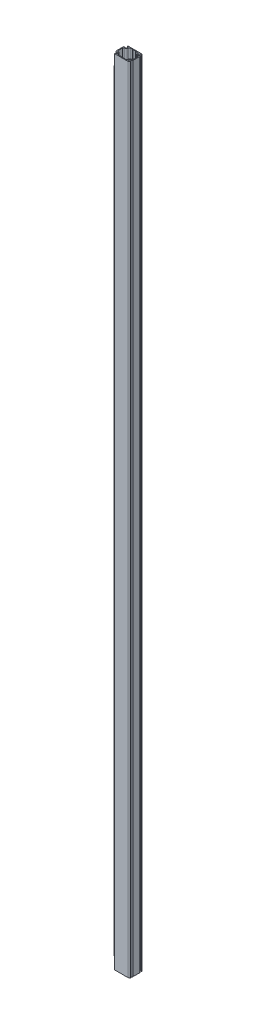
ISO-10303-21;
HEADER;
FILE_DESCRIPTION(('STEP AP214'),'2;1');
FILE_NAME('part.step','',(''),(''),'','','');
FILE_SCHEMA(('AUTOMOTIVE_DESIGN { 1 0 10303 214 1 1 1 1 }'));
ENDSEC;
DATA;
#1=APPLICATION_CONTEXT('core data for automotive mechanical design processes');
#2=APPLICATION_PROTOCOL_DEFINITION('international standard','automotive_design',2000,#1);
#3=PRODUCT_CONTEXT('',#1,'mechanical');
#4=PRODUCT('Part','Part','',(#3));
#5=PRODUCT_RELATED_PRODUCT_CATEGORY('part','',(#4));
#6=PRODUCT_DEFINITION_FORMATION('','',#4);
#7=PRODUCT_DEFINITION_CONTEXT('part definition',#1,'design');
#8=PRODUCT_DEFINITION('design','',#6,#7);
#9=PRODUCT_DEFINITION_SHAPE('','',#8);
#10=(LENGTH_UNIT() NAMED_UNIT(*) SI_UNIT(.MILLI.,.METRE.));
#11=(NAMED_UNIT(*) PLANE_ANGLE_UNIT() SI_UNIT($,.RADIAN.));
#12=(NAMED_UNIT(*) SI_UNIT($,.STERADIAN.) SOLID_ANGLE_UNIT());
#13=UNCERTAINTY_MEASURE_WITH_UNIT(LENGTH_MEASURE(1.E-05),#10,'distance_accuracy_value','');
#14=(GEOMETRIC_REPRESENTATION_CONTEXT(3) GLOBAL_UNCERTAINTY_ASSIGNED_CONTEXT((#13)) GLOBAL_UNIT_ASSIGNED_CONTEXT((#10,
#11,#12)) REPRESENTATION_CONTEXT('',''));
#15=CARTESIAN_POINT('',(0.,0.,0.));
#16=DIRECTION('',(0.,0.,1.));
#17=DIRECTION('',(1.,0.,0.));
#18=AXIS2_PLACEMENT_3D('',#15,#16,#17);
#19=CARTESIAN_POINT('',(-39.5,4753.,-17.8456725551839));
#20=DIRECTION('',(0.,-1.,0.));
#21=DIRECTION('',(0.,0.,-1.));
#22=AXIS2_PLACEMENT_3D('',#19,#20,#21);
#23=CYLINDRICAL_SURFACE('',#22,10.5);
#24=DIRECTION('',(0.,-1.,0.));
#25=VECTOR('',#24,1.);
#26=CARTESIAN_POINT('',(-39.5,4753.,-28.3456725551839));
#27=LINE('',#26,#25);
#28=CARTESIAN_POINT('',(-39.5,4683.,-28.3456725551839));
#29=VERTEX_POINT('',#28);
#30=CARTESIAN_POINT('',(-39.5,70.,-28.3456725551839));
#31=VERTEX_POINT('',#30);
#32=EDGE_CURVE('E693',#29,#31,#27,.T.);
#33=ORIENTED_EDGE('',*,*,#32,.T.);
#34=CARTESIAN_POINT('',(-39.5,70.0000000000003,-17.8456725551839));
#35=DIRECTION('',(0.,-1.,0.));
#36=DIRECTION('',(0.,0.,-1.));
#37=AXIS2_PLACEMENT_3D('',#34,#35,#36);
#38=CIRCLE('',#37,10.5);
#39=CARTESIAN_POINT('',(-49.2420366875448,70.0000000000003,-21.7626511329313));
#40=VERTEX_POINT('',#39);
#41=EDGE_CURVE('E926',#31,#40,#38,.F.);
#42=ORIENTED_EDGE('',*,*,#41,.T.);
#43=DIRECTION('',(0.,-1.,0.));
#44=VECTOR('',#43,1.);
#45=CARTESIAN_POINT('',(-49.2420366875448,4753.,-21.7626511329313));
#46=LINE('',#45,#44);
#47=CARTESIAN_POINT('',(-49.2420366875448,4683.,-21.7626511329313));
#48=VERTEX_POINT('',#47);
#49=EDGE_CURVE('E469',#48,#40,#46,.T.);
#50=ORIENTED_EDGE('',*,*,#49,.F.);
#51=CARTESIAN_POINT('',(-39.5,4683.,-17.8456725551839));
#52=DIRECTION('',(0.,1.,0.));
#53=DIRECTION('',(0.,0.,1.));
#54=AXIS2_PLACEMENT_3D('',#51,#52,#53);
#55=CIRCLE('',#54,10.5);
#56=EDGE_CURVE('E847',#48,#29,#55,.F.);
#57=ORIENTED_EDGE('',*,*,#56,.T.);
#58=EDGE_LOOP('',(#33,#42,#50,#57));
#59=FACE_BOUND('',#58,.T.);
#60=ADVANCED_FACE('F52',(#59),#23,.T.);
#61=CARTESIAN_POINT('',(-47.386410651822,4753.,-21.0165599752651));
#62=DIRECTION('',(0.,-1.,0.));
#63=DIRECTION('',(0.,0.,-1.));
#64=AXIS2_PLACEMENT_3D('',#61,#62,#63);
#65=CYLINDRICAL_SURFACE('',#64,2.);
#66=ORIENTED_EDGE('',*,*,#49,.T.);
#67=CARTESIAN_POINT('',(-47.386410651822,70.0000000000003,-21.0165599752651));
#68=DIRECTION('',(0.,-1.,0.));
#69=DIRECTION('',(0.,0.,-1.));
#70=AXIS2_PLACEMENT_3D('',#67,#68,#69);
#71=CIRCLE('',#70,2.);
#72=CARTESIAN_POINT('',(-45.5307846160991,70.0000000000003,-20.2704688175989));
#73=VERTEX_POINT('',#72);
#74=EDGE_CURVE('E1478',#40,#73,#71,.F.);
#75=ORIENTED_EDGE('',*,*,#74,.T.);
#76=DIRECTION('',(0.,-1.,0.));
#77=VECTOR('',#76,1.);
#78=CARTESIAN_POINT('',(-45.5307846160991,4753.,-20.2704688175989));
#79=LINE('',#78,#77);
#80=CARTESIAN_POINT('',(-45.5307846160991,4683.,-20.2704688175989));
#81=VERTEX_POINT('',#80);
#82=EDGE_CURVE('E466',#81,#73,#79,.T.);
#83=ORIENTED_EDGE('',*,*,#82,.F.);
#84=CARTESIAN_POINT('',(-47.386410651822,4683.,-21.0165599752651));
#85=DIRECTION('',(0.,1.,0.));
#86=DIRECTION('',(0.,0.,1.));
#87=AXIS2_PLACEMENT_3D('',#84,#85,#86);
#88=CIRCLE('',#87,2.);
#89=EDGE_CURVE('E1498',#81,#48,#88,.F.);
#90=ORIENTED_EDGE('',*,*,#89,.T.);
#91=EDGE_LOOP('',(#66,#75,#83,#90));
#92=FACE_BOUND('',#91,.T.);
#93=ADVANCED_FACE('F916',(#92),#65,.T.);
#94=CARTESIAN_POINT('',(-39.5,4753.,-17.8456725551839));
#95=DIRECTION('',(0.,-1.,0.));
#96=DIRECTION('',(0.,0.,-1.));
#97=AXIS2_PLACEMENT_3D('',#94,#95,#96);
#98=CYLINDRICAL_SURFACE('',#97,10.5);
#99=CARTESIAN_POINT('',(-39.5,0.,-17.8456725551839));
#100=DIRECTION('',(0.,1.,0.));
#101=DIRECTION('',(0.,0.,1.));
#102=AXIS2_PLACEMENT_3D('',#99,#100,#101);
#103=CIRCLE('',#102,10.5);
#104=CARTESIAN_POINT('',(-29.,0.,-17.8456725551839));
#105=VERTEX_POINT('',#104);
#106=CARTESIAN_POINT('',(-39.5,0.,-7.34567255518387));
#107=VERTEX_POINT('',#106);
#108=EDGE_CURVE('E526',#105,#107,#103,.F.);
#109=ORIENTED_EDGE('',*,*,#108,.F.);
#110=DIRECTION('',(0.,-1.,0.));
#111=VECTOR('',#110,1.);
#112=CARTESIAN_POINT('',(-29.,4753.,-17.8456725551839));
#113=LINE('',#112,#111);
#114=CARTESIAN_POINT('',(-29.,4753.,-17.8456725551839));
#115=VERTEX_POINT('',#114);
#116=EDGE_CURVE('E476',#115,#105,#113,.T.);
#117=ORIENTED_EDGE('',*,*,#116,.F.);
#118=CARTESIAN_POINT('',(-39.5,4753.,-17.8456725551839));
#119=DIRECTION('',(0.,1.,0.));
#120=DIRECTION('',(0.,0.,1.));
#121=AXIS2_PLACEMENT_3D('',#118,#119,#120);
#122=CIRCLE('',#121,10.5);
#123=CARTESIAN_POINT('',(-39.5,4753.,-7.34567255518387));
#124=VERTEX_POINT('',#123);
#125=EDGE_CURVE('E758',#115,#124,#122,.F.);
#126=ORIENTED_EDGE('',*,*,#125,.T.);
#127=DIRECTION('',(0.,-1.,0.));
#128=VECTOR('',#127,1.);
#129=CARTESIAN_POINT('',(-39.5,4753.,-7.34567255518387));
#130=LINE('',#129,#128);
#131=EDGE_CURVE('E472',#124,#107,#130,.T.);
#132=ORIENTED_EDGE('',*,*,#131,.T.);
#133=EDGE_LOOP('',(#109,#117,#126,#132));
#134=FACE_BOUND('',#133,.T.);
#135=ADVANCED_FACE('F921',(#134),#98,.T.);
#136=CARTESIAN_POINT('',(-22.5,4753.,-17.8456725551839));
#137=DIRECTION('',(0.,-1.,0.));
#138=DIRECTION('',(0.,0.,-1.));
#139=AXIS2_PLACEMENT_3D('',#136,#137,#138);
#140=CYLINDRICAL_SURFACE('',#139,6.49999999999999);
#141=CARTESIAN_POINT('',(-22.5,0.,-17.8456725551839));
#142=DIRECTION('',(0.,1.,0.));
#143=DIRECTION('',(0.,0.,1.));
#144=AXIS2_PLACEMENT_3D('',#141,#142,#143);
#145=CIRCLE('',#144,6.49999999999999);
#146=CARTESIAN_POINT('',(-22.5,0.,-24.3456725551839));
#147=VERTEX_POINT('',#146);
#148=EDGE_CURVE('E529',#105,#147,#145,.F.);
#149=ORIENTED_EDGE('',*,*,#148,.T.);
#150=DIRECTION('',(0.,-1.,0.));
#151=VECTOR('',#150,1.);
#152=CARTESIAN_POINT('',(-22.5,4753.,-24.3456725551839));
#153=LINE('',#152,#151);
#154=CARTESIAN_POINT('',(-22.5,4753.,-24.3456725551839));
#155=VERTEX_POINT('',#154);
#156=EDGE_CURVE('E685',#155,#147,#153,.T.);
#157=ORIENTED_EDGE('',*,*,#156,.F.);
#158=CARTESIAN_POINT('',(-22.5,4753.,-17.8456725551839));
#159=DIRECTION('',(0.,1.,0.));
#160=DIRECTION('',(0.,0.,1.));
#161=AXIS2_PLACEMENT_3D('',#158,#159,#160);
#162=CIRCLE('',#161,6.49999999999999);
#163=EDGE_CURVE('E761',#115,#155,#162,.F.);
#164=ORIENTED_EDGE('',*,*,#163,.F.);
#165=ORIENTED_EDGE('',*,*,#116,.T.);
#166=EDGE_LOOP('',(#149,#157,#164,#165));
#167=FACE_BOUND('',#166,.T.);
#168=ADVANCED_FACE('F942',(#167),#140,.F.);
#169=CARTESIAN_POINT('',(0.,4753.,-24.3456725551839));
#170=DIRECTION('',(0.,0.,-1.));
#171=DIRECTION('',(-1.,0.,0.));
#172=AXIS2_PLACEMENT_3D('',#169,#170,#171);
#173=PLANE('',#172);
#174=DIRECTION('',(1.,0.,0.));
#175=VECTOR('',#174,1.);
#176=CARTESIAN_POINT('',(0.,0.,-24.3456725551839));
#177=LINE('',#176,#175);
#178=CARTESIAN_POINT('',(-12.5,0.,-24.3456725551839));
#179=VERTEX_POINT('',#178);
#180=EDGE_CURVE('E532',#147,#179,#177,.T.);
#181=ORIENTED_EDGE('',*,*,#180,.T.);
#182=DIRECTION('',(0.,-1.,0.));
#183=VECTOR('',#182,1.);
#184=CARTESIAN_POINT('',(-12.5,4753.,-24.3456725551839));
#185=LINE('',#184,#183);
#186=CARTESIAN_POINT('',(-12.5,4753.,-24.3456725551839));
#187=VERTEX_POINT('',#186);
#188=EDGE_CURVE('E683',#187,#179,#185,.T.);
#189=ORIENTED_EDGE('',*,*,#188,.F.);
#190=DIRECTION('',(1.,0.,0.));
#191=VECTOR('',#190,1.);
#192=CARTESIAN_POINT('',(0.,4753.,-24.3456725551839));
#193=LINE('',#192,#191);
#194=EDGE_CURVE('E764',#155,#187,#193,.T.);
#195=ORIENTED_EDGE('',*,*,#194,.F.);
#196=ORIENTED_EDGE('',*,*,#156,.T.);
#197=EDGE_LOOP('',(#181,#189,#195,#196));
#198=FACE_BOUND('',#197,.T.);
#199=ADVANCED_FACE('F946',(#198),#173,.F.);
#200=CARTESIAN_POINT('',(5.92283627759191,4753.,-5.9228362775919));
#201=DIRECTION('',(-0.707106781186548,0.,0.707106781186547));
#202=DIRECTION('',(0.707106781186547,0.,0.707106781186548));
#203=AXIS2_PLACEMENT_3D('',#200,#201,#202);
#204=PLANE('',#203);
#205=DIRECTION('',(-0.707106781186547,0.,-0.707106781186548));
#206=VECTOR('',#205,1.);
#207=CARTESIAN_POINT('',(5.92283627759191,0.,-5.9228362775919));
#208=LINE('',#207,#206);
#209=CARTESIAN_POINT('',(-11.,0.,-22.8456725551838));
#210=VERTEX_POINT('',#209);
#211=EDGE_CURVE('E535',#210,#179,#208,.T.);
#212=ORIENTED_EDGE('',*,*,#211,.F.);
#213=DIRECTION('',(0.,-1.,0.));
#214=VECTOR('',#213,1.);
#215=CARTESIAN_POINT('',(-11.,4753.,-22.8456725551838));
#216=LINE('',#215,#214);
#217=CARTESIAN_POINT('',(-11.,4753.,-22.8456725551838));
#218=VERTEX_POINT('',#217);
#219=EDGE_CURVE('E681',#218,#210,#216,.T.);
#220=ORIENTED_EDGE('',*,*,#219,.F.);
#221=DIRECTION('',(-0.707106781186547,0.,-0.707106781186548));
#222=VECTOR('',#221,1.);
#223=CARTESIAN_POINT('',(5.92283627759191,4753.,-5.9228362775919));
#224=LINE('',#223,#222);
#225=EDGE_CURVE('E766',#218,#187,#224,.T.);
#226=ORIENTED_EDGE('',*,*,#225,.T.);
#227=ORIENTED_EDGE('',*,*,#188,.T.);
#228=EDGE_LOOP('',(#212,#220,#226,#227));
#229=FACE_BOUND('',#228,.T.);
#230=ADVANCED_FACE('F950',(#229),#204,.T.);
#231=CARTESIAN_POINT('',(0.,4753.,-22.8456725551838));
#232=DIRECTION('',(0.,0.,-1.));
#233=DIRECTION('',(-1.,0.,0.));
#234=AXIS2_PLACEMENT_3D('',#231,#232,#233);
#235=PLANE('',#234);
#236=DIRECTION('',(1.,0.,0.));
#237=VECTOR('',#236,1.);
#238=CARTESIAN_POINT('',(0.,0.,-22.8456725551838));
#239=LINE('',#238,#237);
#240=CARTESIAN_POINT('',(-8.,0.,-22.8456725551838));
#241=VERTEX_POINT('',#240);
#242=EDGE_CURVE('E538',#210,#241,#239,.T.);
#243=ORIENTED_EDGE('',*,*,#242,.T.);
#244=DIRECTION('',(0.,-1.,0.));
#245=VECTOR('',#244,1.);
#246=CARTESIAN_POINT('',(-8.,4753.,-22.8456725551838));
#247=LINE('',#246,#245);
#248=CARTESIAN_POINT('',(-8.,4753.,-22.8456725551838));
#249=VERTEX_POINT('',#248);
#250=EDGE_CURVE('E678',#249,#241,#247,.T.);
#251=ORIENTED_EDGE('',*,*,#250,.F.);
#252=DIRECTION('',(1.,0.,0.));
#253=VECTOR('',#252,1.);
#254=CARTESIAN_POINT('',(0.,4753.,-22.8456725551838));
#255=LINE('',#254,#253);
#256=EDGE_CURVE('E769',#218,#249,#255,.T.);
#257=ORIENTED_EDGE('',*,*,#256,.F.);
#258=ORIENTED_EDGE('',*,*,#219,.T.);
#259=EDGE_LOOP('',(#243,#251,#257,#258));
#260=FACE_BOUND('',#259,.T.);
#261=ADVANCED_FACE('F954',(#260),#235,.F.);
#262=CARTESIAN_POINT('',(-15.4228362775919,4753.,-15.422836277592));
#263=DIRECTION('',(-0.707106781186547,0.,-0.707106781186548));
#264=DIRECTION('',(-0.707106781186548,0.,0.707106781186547));
#265=AXIS2_PLACEMENT_3D('',#262,#263,#264);
#266=PLANE('',#265);
#267=DIRECTION('',(0.707106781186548,0.,-0.707106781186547));
#268=VECTOR('',#267,1.);
#269=CARTESIAN_POINT('',(-15.4228362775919,0.,-15.422836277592));
#270=LINE('',#269,#268);
#271=CARTESIAN_POINT('',(-6.50000000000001,0.,-24.3456725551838));
#272=VERTEX_POINT('',#271);
#273=EDGE_CURVE('E541',#241,#272,#270,.T.);
#274=ORIENTED_EDGE('',*,*,#273,.T.);
#275=DIRECTION('',(0.,-1.,0.));
#276=VECTOR('',#275,1.);
#277=CARTESIAN_POINT('',(-6.50000000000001,4753.,-24.3456725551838));
#278=LINE('',#277,#276);
#279=CARTESIAN_POINT('',(-6.50000000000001,4753.,-24.3456725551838));
#280=VERTEX_POINT('',#279);
#281=EDGE_CURVE('E676',#280,#272,#278,.T.);
#282=ORIENTED_EDGE('',*,*,#281,.F.);
#283=DIRECTION('',(0.707106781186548,0.,-0.707106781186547));
#284=VECTOR('',#283,1.);
#285=CARTESIAN_POINT('',(-15.4228362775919,4753.,-15.422836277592));
#286=LINE('',#285,#284);
#287=EDGE_CURVE('E772',#249,#280,#286,.T.);
#288=ORIENTED_EDGE('',*,*,#287,.F.);
#289=ORIENTED_EDGE('',*,*,#250,.T.);
#290=EDGE_LOOP('',(#274,#282,#288,#289));
#291=FACE_BOUND('',#290,.T.);
#292=ADVANCED_FACE('F958',(#291),#266,.F.);
#293=CARTESIAN_POINT('',(0.,4753.,-24.3456725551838));
#294=DIRECTION('',(0.,0.,1.));
#295=DIRECTION('',(1.,0.,0.));
#296=AXIS2_PLACEMENT_3D('',#293,#294,#295);
#297=PLANE('',#296);
#298=DIRECTION('',(-1.,0.,0.));
#299=VECTOR('',#298,1.);
#300=CARTESIAN_POINT('',(0.,0.,-24.3456725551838));
#301=LINE('',#300,#299);
#302=CARTESIAN_POINT('',(6.50000000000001,0.,-24.3456725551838));
#303=VERTEX_POINT('',#302);
#304=EDGE_CURVE('E544',#303,#272,#301,.T.);
#305=ORIENTED_EDGE('',*,*,#304,.F.);
#306=DIRECTION('',(0.,-1.,0.));
#307=VECTOR('',#306,1.);
#308=CARTESIAN_POINT('',(6.50000000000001,4753.,-24.3456725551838));
#309=LINE('',#308,#307);
#310=CARTESIAN_POINT('',(6.50000000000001,4753.,-24.3456725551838));
#311=VERTEX_POINT('',#310);
#312=EDGE_CURVE('E674',#311,#303,#309,.T.);
#313=ORIENTED_EDGE('',*,*,#312,.F.);
#314=DIRECTION('',(-1.,0.,0.));
#315=VECTOR('',#314,1.);
#316=CARTESIAN_POINT('',(0.,4753.,-24.3456725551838));
#317=LINE('',#316,#315);
#318=EDGE_CURVE('E774',#311,#280,#317,.T.);
#319=ORIENTED_EDGE('',*,*,#318,.T.);
#320=ORIENTED_EDGE('',*,*,#281,.T.);
#321=EDGE_LOOP('',(#305,#313,#319,#320));
#322=FACE_BOUND('',#321,.T.);
#323=ADVANCED_FACE('F962',(#322),#297,.T.);
#324=CARTESIAN_POINT('',(15.4228362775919,4753.,-15.422836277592));
#325=DIRECTION('',(-0.707106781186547,0.,0.707106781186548));
#326=DIRECTION('',(0.707106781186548,0.,0.707106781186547));
#327=AXIS2_PLACEMENT_3D('',#324,#325,#326);
#328=PLANE('',#327);
#329=DIRECTION('',(-0.707106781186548,0.,-0.707106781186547));
#330=VECTOR('',#329,1.);
#331=CARTESIAN_POINT('',(15.4228362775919,0.,-15.422836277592));
#332=LINE('',#331,#330);
#333=CARTESIAN_POINT('',(8.,0.,-22.8456725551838));
#334=VERTEX_POINT('',#333);
#335=EDGE_CURVE('E547',#334,#303,#332,.T.);
#336=ORIENTED_EDGE('',*,*,#335,.F.);
#337=DIRECTION('',(0.,-1.,0.));
#338=VECTOR('',#337,1.);
#339=CARTESIAN_POINT('',(8.,4753.,-22.8456725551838));
#340=LINE('',#339,#338);
#341=CARTESIAN_POINT('',(8.,4753.,-22.8456725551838));
#342=VERTEX_POINT('',#341);
#343=EDGE_CURVE('E672',#342,#334,#340,.T.);
#344=ORIENTED_EDGE('',*,*,#343,.F.);
#345=DIRECTION('',(-0.707106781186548,0.,-0.707106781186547));
#346=VECTOR('',#345,1.);
#347=CARTESIAN_POINT('',(15.4228362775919,4753.,-15.422836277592));
#348=LINE('',#347,#346);
#349=EDGE_CURVE('E777',#342,#311,#348,.T.);
#350=ORIENTED_EDGE('',*,*,#349,.T.);
#351=ORIENTED_EDGE('',*,*,#312,.T.);
#352=EDGE_LOOP('',(#336,#344,#350,#351));
#353=FACE_BOUND('',#352,.T.);
#354=ADVANCED_FACE('F966',(#353),#328,.T.);
#355=CARTESIAN_POINT('',(0.,4753.,-22.8456725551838));
#356=DIRECTION('',(0.,0.,1.));
#357=DIRECTION('',(1.,0.,0.));
#358=AXIS2_PLACEMENT_3D('',#355,#356,#357);
#359=PLANE('',#358);
#360=DIRECTION('',(-1.,0.,0.));
#361=VECTOR('',#360,1.);
#362=CARTESIAN_POINT('',(0.,0.,-22.8456725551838));
#363=LINE('',#362,#361);
#364=CARTESIAN_POINT('',(11.,0.,-22.8456725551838));
#365=VERTEX_POINT('',#364);
#366=EDGE_CURVE('E550',#365,#334,#363,.T.);
#367=ORIENTED_EDGE('',*,*,#366,.F.);
#368=DIRECTION('',(0.,-1.,0.));
#369=VECTOR('',#368,1.);
#370=CARTESIAN_POINT('',(11.,4753.,-22.8456725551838));
#371=LINE('',#370,#369);
#372=CARTESIAN_POINT('',(11.,4753.,-22.8456725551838));
#373=VERTEX_POINT('',#372);
#374=EDGE_CURVE('E670',#373,#365,#371,.T.);
#375=ORIENTED_EDGE('',*,*,#374,.F.);
#376=DIRECTION('',(-1.,0.,0.));
#377=VECTOR('',#376,1.);
#378=CARTESIAN_POINT('',(0.,4753.,-22.8456725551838));
#379=LINE('',#378,#377);
#380=EDGE_CURVE('E780',#373,#342,#379,.T.);
#381=ORIENTED_EDGE('',*,*,#380,.T.);
#382=ORIENTED_EDGE('',*,*,#343,.T.);
#383=EDGE_LOOP('',(#367,#375,#381,#382));
#384=FACE_BOUND('',#383,.T.);
#385=ADVANCED_FACE('F970',(#384),#359,.T.);
#386=CARTESIAN_POINT('',(-5.92283627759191,4753.,-5.9228362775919));
#387=DIRECTION('',(-0.707106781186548,0.,-0.707106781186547));
#388=DIRECTION('',(-0.707106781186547,0.,0.707106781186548));
#389=AXIS2_PLACEMENT_3D('',#386,#387,#388);
#390=PLANE('',#389);
#391=DIRECTION('',(0.707106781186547,0.,-0.707106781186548));
#392=VECTOR('',#391,1.);
#393=CARTESIAN_POINT('',(-5.92283627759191,0.,-5.9228362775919));
#394=LINE('',#393,#392);
#395=CARTESIAN_POINT('',(12.5,0.,-24.3456725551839));
#396=VERTEX_POINT('',#395);
#397=EDGE_CURVE('E553',#365,#396,#394,.T.);
#398=ORIENTED_EDGE('',*,*,#397,.T.);
#399=DIRECTION('',(0.,-1.,0.));
#400=VECTOR('',#399,1.);
#401=CARTESIAN_POINT('',(12.5,4753.,-24.3456725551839));
#402=LINE('',#401,#400);
#403=CARTESIAN_POINT('',(12.5,4753.,-24.3456725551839));
#404=VERTEX_POINT('',#403);
#405=EDGE_CURVE('E668',#404,#396,#402,.T.);
#406=ORIENTED_EDGE('',*,*,#405,.F.);
#407=DIRECTION('',(0.707106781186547,0.,-0.707106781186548));
#408=VECTOR('',#407,1.);
#409=CARTESIAN_POINT('',(-5.92283627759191,4753.,-5.9228362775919));
#410=LINE('',#409,#408);
#411=EDGE_CURVE('E783',#373,#404,#410,.T.);
#412=ORIENTED_EDGE('',*,*,#411,.F.);
#413=ORIENTED_EDGE('',*,*,#374,.T.);
#414=EDGE_LOOP('',(#398,#406,#412,#413));
#415=FACE_BOUND('',#414,.T.);
#416=ADVANCED_FACE('F974',(#415),#390,.F.);
#417=CARTESIAN_POINT('',(0.,4753.,-24.3456725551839));
#418=DIRECTION('',(0.,0.,1.));
#419=DIRECTION('',(1.,0.,0.));
#420=AXIS2_PLACEMENT_3D('',#417,#418,#419);
#421=PLANE('',#420);
#422=DIRECTION('',(-1.,0.,0.));
#423=VECTOR('',#422,1.);
#424=CARTESIAN_POINT('',(0.,0.,-24.3456725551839));
#425=LINE('',#424,#423);
#426=CARTESIAN_POINT('',(22.5,0.,-24.3456725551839));
#427=VERTEX_POINT('',#426);
#428=EDGE_CURVE('E556',#427,#396,#425,.T.);
#429=ORIENTED_EDGE('',*,*,#428,.F.);
#430=DIRECTION('',(0.,-1.,0.));
#431=VECTOR('',#430,1.);
#432=CARTESIAN_POINT('',(22.5,4753.,-24.3456725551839));
#433=LINE('',#432,#431);
#434=CARTESIAN_POINT('',(22.5,4753.,-24.3456725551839));
#435=VERTEX_POINT('',#434);
#436=EDGE_CURVE('E666',#435,#427,#433,.T.);
#437=ORIENTED_EDGE('',*,*,#436,.F.);
#438=DIRECTION('',(-1.,0.,0.));
#439=VECTOR('',#438,1.);
#440=CARTESIAN_POINT('',(0.,4753.,-24.3456725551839));
#441=LINE('',#440,#439);
#442=EDGE_CURVE('E785',#435,#404,#441,.T.);
#443=ORIENTED_EDGE('',*,*,#442,.T.);
#444=ORIENTED_EDGE('',*,*,#405,.T.);
#445=EDGE_LOOP('',(#429,#437,#443,#444));
#446=FACE_BOUND('',#445,.T.);
#447=ADVANCED_FACE('F978',(#446),#421,.T.);
#448=CARTESIAN_POINT('',(22.5,4753.,-17.8456725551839));
#449=DIRECTION('',(0.,-1.,0.));
#450=DIRECTION('',(0.,0.,-1.));
#451=AXIS2_PLACEMENT_3D('',#448,#449,#450);
#452=CYLINDRICAL_SURFACE('',#451,6.49999999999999);
#453=CARTESIAN_POINT('',(22.5,0.,-17.8456725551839));
#454=DIRECTION('',(0.,1.,0.));
#455=DIRECTION('',(0.,0.,1.));
#456=AXIS2_PLACEMENT_3D('',#453,#454,#455);
#457=CIRCLE('',#456,6.49999999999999);
#458=CARTESIAN_POINT('',(29.,0.,-17.8456725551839));
#459=VERTEX_POINT('',#458);
#460=EDGE_CURVE('E559',#459,#427,#457,.T.);
#461=ORIENTED_EDGE('',*,*,#460,.F.);
#462=DIRECTION('',(0.,-1.,0.));
#463=VECTOR('',#462,1.);
#464=CARTESIAN_POINT('',(29.,4753.,-17.8456725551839));
#465=LINE('',#464,#463);
#466=CARTESIAN_POINT('',(29.,4753.,-17.8456725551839));
#467=VERTEX_POINT('',#466);
#468=EDGE_CURVE('E664',#467,#459,#465,.T.);
#469=ORIENTED_EDGE('',*,*,#468,.F.);
#470=CARTESIAN_POINT('',(22.5,4753.,-17.8456725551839));
#471=DIRECTION('',(0.,1.,0.));
#472=DIRECTION('',(0.,0.,1.));
#473=AXIS2_PLACEMENT_3D('',#470,#471,#472);
#474=CIRCLE('',#473,6.49999999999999);
#475=EDGE_CURVE('E788',#467,#435,#474,.T.);
#476=ORIENTED_EDGE('',*,*,#475,.T.);
#477=ORIENTED_EDGE('',*,*,#436,.T.);
#478=EDGE_LOOP('',(#461,#469,#476,#477));
#479=FACE_BOUND('',#478,.T.);
#480=ADVANCED_FACE('F982',(#479),#452,.F.);
#481=CARTESIAN_POINT('',(39.5,4753.,-17.8456725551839));
#482=DIRECTION('',(0.,-1.,0.));
#483=DIRECTION('',(0.,0.,-1.));
#484=AXIS2_PLACEMENT_3D('',#481,#482,#483);
#485=CYLINDRICAL_SURFACE('',#484,10.5);
#486=CARTESIAN_POINT('',(39.5,0.,-17.8456725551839));
#487=DIRECTION('',(0.,1.,0.));
#488=DIRECTION('',(0.,0.,1.));
#489=AXIS2_PLACEMENT_3D('',#486,#487,#488);
#490=CIRCLE('',#489,10.5);
#491=CARTESIAN_POINT('',(39.5,0.,-7.34567255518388));
#492=VERTEX_POINT('',#491);
#493=EDGE_CURVE('E562',#459,#492,#490,.T.);
#494=ORIENTED_EDGE('',*,*,#493,.T.);
#495=DIRECTION('',(0.,-1.,0.));
#496=VECTOR('',#495,1.);
#497=CARTESIAN_POINT('',(39.5,4753.,-7.34567255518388));
#498=LINE('',#497,#496);
#499=CARTESIAN_POINT('',(39.5,4753.,-7.34567255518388));
#500=VERTEX_POINT('',#499);
#501=EDGE_CURVE('E662',#500,#492,#498,.T.);
#502=ORIENTED_EDGE('',*,*,#501,.F.);
#503=CARTESIAN_POINT('',(39.5,4753.,-17.8456725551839));
#504=DIRECTION('',(0.,1.,0.));
#505=DIRECTION('',(0.,0.,1.));
#506=AXIS2_PLACEMENT_3D('',#503,#504,#505);
#507=CIRCLE('',#506,10.5);
#508=EDGE_CURVE('E791',#467,#500,#507,.T.);
#509=ORIENTED_EDGE('',*,*,#508,.F.);
#510=ORIENTED_EDGE('',*,*,#468,.T.);
#511=EDGE_LOOP('',(#494,#502,#509,#510));
#512=FACE_BOUND('',#511,.T.);
#513=ADVANCED_FACE('F986',(#512),#485,.T.);
#514=CARTESIAN_POINT('',(39.5,4753.,-0.845672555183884));
#515=DIRECTION('',(0.,-1.,0.));
#516=DIRECTION('',(0.,0.,-1.));
#517=AXIS2_PLACEMENT_3D('',#514,#515,#516);
#518=CYLINDRICAL_SURFACE('',#517,6.49999999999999);
#519=CARTESIAN_POINT('',(39.5,0.,-0.845672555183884));
#520=DIRECTION('',(0.,1.,0.));
#521=DIRECTION('',(0.,0.,1.));
#522=AXIS2_PLACEMENT_3D('',#519,#520,#521);
#523=CIRCLE('',#522,6.49999999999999);
#524=CARTESIAN_POINT('',(46.,0.,-0.845672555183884));
#525=VERTEX_POINT('',#524);
#526=EDGE_CURVE('E565',#525,#492,#523,.T.);
#527=ORIENTED_EDGE('',*,*,#526,.F.);
#528=DIRECTION('',(0.,-1.,0.));
#529=VECTOR('',#528,1.);
#530=CARTESIAN_POINT('',(46.,4753.,-0.845672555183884));
#531=LINE('',#530,#529);
#532=CARTESIAN_POINT('',(46.,4753.,-0.845672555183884));
#533=VERTEX_POINT('',#532);
#534=EDGE_CURVE('E660',#533,#525,#531,.T.);
#535=ORIENTED_EDGE('',*,*,#534,.F.);
#536=CARTESIAN_POINT('',(39.5,4753.,-0.845672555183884));
#537=DIRECTION('',(0.,1.,0.));
#538=DIRECTION('',(0.,0.,1.));
#539=AXIS2_PLACEMENT_3D('',#536,#537,#538);
#540=CIRCLE('',#539,6.49999999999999);
#541=EDGE_CURVE('E793',#533,#500,#540,.T.);
#542=ORIENTED_EDGE('',*,*,#541,.T.);
#543=ORIENTED_EDGE('',*,*,#501,.T.);
#544=EDGE_LOOP('',(#527,#535,#542,#543));
#545=FACE_BOUND('',#544,.T.);
#546=ADVANCED_FACE('F990',(#545),#518,.F.);
#547=CARTESIAN_POINT('',(46.,4753.,0.));
#548=DIRECTION('',(-1.,0.,0.));
#549=DIRECTION('',(0.,0.,1.));
#550=AXIS2_PLACEMENT_3D('',#547,#548,#549);
#551=PLANE('',#550);
#552=DIRECTION('',(0.,0.,-1.));
#553=VECTOR('',#552,1.);
#554=CARTESIAN_POINT('',(46.,0.,0.));
#555=LINE('',#554,#553);
#556=CARTESIAN_POINT('',(46.,0.,24.1543274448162));
#557=VERTEX_POINT('',#556);
#558=EDGE_CURVE('E568',#557,#525,#555,.T.);
#559=ORIENTED_EDGE('',*,*,#558,.F.);
#560=DIRECTION('',(0.,-1.,0.));
#561=VECTOR('',#560,1.);
#562=CARTESIAN_POINT('',(46.,4753.,24.1543274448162));
#563=LINE('',#562,#561);
#564=CARTESIAN_POINT('',(46.,4753.,24.1543274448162));
#565=VERTEX_POINT('',#564);
#566=EDGE_CURVE('E658',#565,#557,#563,.T.);
#567=ORIENTED_EDGE('',*,*,#566,.F.);
#568=DIRECTION('',(0.,0.,-1.));
#569=VECTOR('',#568,1.);
#570=CARTESIAN_POINT('',(46.,4753.,0.));
#571=LINE('',#570,#569);
#572=EDGE_CURVE('E796',#565,#533,#571,.T.);
#573=ORIENTED_EDGE('',*,*,#572,.T.);
#574=ORIENTED_EDGE('',*,*,#534,.T.);
#575=EDGE_LOOP('',(#559,#567,#573,#574));
#576=FACE_BOUND('',#575,.T.);
#577=ADVANCED_FACE('F994',(#576),#551,.T.);
#578=CARTESIAN_POINT('',(39.5,4753.,24.1543274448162));
#579=DIRECTION('',(0.,-1.,0.));
#580=DIRECTION('',(0.,0.,-1.));
#581=AXIS2_PLACEMENT_3D('',#578,#579,#580);
#582=CYLINDRICAL_SURFACE('',#581,6.49999999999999);
#583=CARTESIAN_POINT('',(39.5,0.,24.1543274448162));
#584=DIRECTION('',(0.,1.,0.));
#585=DIRECTION('',(0.,0.,1.));
#586=AXIS2_PLACEMENT_3D('',#583,#584,#585);
#587=CIRCLE('',#586,6.49999999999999);
#588=CARTESIAN_POINT('',(39.5,0.,30.6543274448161));
#589=VERTEX_POINT('',#588);
#590=EDGE_CURVE('E571',#557,#589,#587,.F.);
#591=ORIENTED_EDGE('',*,*,#590,.T.);
#592=DIRECTION('',(0.,-1.,0.));
#593=VECTOR('',#592,1.);
#594=CARTESIAN_POINT('',(39.5,4753.,30.6543274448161));
#595=LINE('',#594,#593);
#596=CARTESIAN_POINT('',(39.5,4753.,30.6543274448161));
#597=VERTEX_POINT('',#596);
#598=EDGE_CURVE('E656',#597,#589,#595,.T.);
#599=ORIENTED_EDGE('',*,*,#598,.F.);
#600=CARTESIAN_POINT('',(39.5,4753.,24.1543274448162));
#601=DIRECTION('',(0.,1.,0.));
#602=DIRECTION('',(0.,0.,1.));
#603=AXIS2_PLACEMENT_3D('',#600,#601,#602);
#604=CIRCLE('',#603,6.49999999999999);
#605=EDGE_CURVE('E799',#565,#597,#604,.F.);
#606=ORIENTED_EDGE('',*,*,#605,.F.);
#607=ORIENTED_EDGE('',*,*,#566,.T.);
#608=EDGE_LOOP('',(#591,#599,#606,#607));
#609=FACE_BOUND('',#608,.T.);
#610=ADVANCED_FACE('F998',(#609),#582,.F.);
#611=CARTESIAN_POINT('',(39.5,4753.,41.1543274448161));
#612=DIRECTION('',(0.,-1.,0.));
#613=DIRECTION('',(0.,0.,-1.));
#614=AXIS2_PLACEMENT_3D('',#611,#612,#613);
#615=CYLINDRICAL_SURFACE('',#614,10.5);
#616=CARTESIAN_POINT('',(39.5,0.,41.1543274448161));
#617=DIRECTION('',(0.,1.,0.));
#618=DIRECTION('',(0.,0.,1.));
#619=AXIS2_PLACEMENT_3D('',#616,#617,#618);
#620=CIRCLE('',#619,10.5);
#621=CARTESIAN_POINT('',(29.,0.,41.1543274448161));
#622=VERTEX_POINT('',#621);
#623=EDGE_CURVE('E574',#622,#589,#620,.F.);
#624=ORIENTED_EDGE('',*,*,#623,.F.);
#625=DIRECTION('',(0.,-1.,0.));
#626=VECTOR('',#625,1.);
#627=CARTESIAN_POINT('',(29.,4753.,41.1543274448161));
#628=LINE('',#627,#626);
#629=CARTESIAN_POINT('',(29.,4753.,41.1543274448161));
#630=VERTEX_POINT('',#629);
#631=EDGE_CURVE('E654',#630,#622,#628,.T.);
#632=ORIENTED_EDGE('',*,*,#631,.F.);
#633=CARTESIAN_POINT('',(39.5,4753.,41.1543274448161));
#634=DIRECTION('',(0.,1.,0.));
#635=DIRECTION('',(0.,0.,1.));
#636=AXIS2_PLACEMENT_3D('',#633,#634,#635);
#637=CIRCLE('',#636,10.5);
#638=EDGE_CURVE('E801',#630,#597,#637,.F.);
#639=ORIENTED_EDGE('',*,*,#638,.T.);
#640=ORIENTED_EDGE('',*,*,#598,.T.);
#641=EDGE_LOOP('',(#624,#632,#639,#640));
#642=FACE_BOUND('',#641,.T.);
#643=ADVANCED_FACE('F1002',(#642),#615,.T.);
#644=CARTESIAN_POINT('',(22.5,4753.,41.1543274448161));
#645=DIRECTION('',(0.,-1.,0.));
#646=DIRECTION('',(0.,0.,-1.));
#647=AXIS2_PLACEMENT_3D('',#644,#645,#646);
#648=CYLINDRICAL_SURFACE('',#647,6.5);
#649=CARTESIAN_POINT('',(22.5,0.,41.1543274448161));
#650=DIRECTION('',(0.,1.,0.));
#651=DIRECTION('',(0.,0.,1.));
#652=AXIS2_PLACEMENT_3D('',#649,#650,#651);
#653=CIRCLE('',#652,6.5);
#654=CARTESIAN_POINT('',(22.5,0.,47.6543274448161));
#655=VERTEX_POINT('',#654);
#656=EDGE_CURVE('E577',#622,#655,#653,.F.);
#657=ORIENTED_EDGE('',*,*,#656,.T.);
#658=DIRECTION('',(0.,-1.,0.));
#659=VECTOR('',#658,1.);
#660=CARTESIAN_POINT('',(22.5,4753.,47.6543274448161));
#661=LINE('',#660,#659);
#662=CARTESIAN_POINT('',(22.5,4753.,47.6543274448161));
#663=VERTEX_POINT('',#662);
#664=EDGE_CURVE('E652',#663,#655,#661,.T.);
#665=ORIENTED_EDGE('',*,*,#664,.F.);
#666=CARTESIAN_POINT('',(22.5,4753.,41.1543274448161));
#667=DIRECTION('',(0.,1.,0.));
#668=DIRECTION('',(0.,0.,1.));
#669=AXIS2_PLACEMENT_3D('',#666,#667,#668);
#670=CIRCLE('',#669,6.5);
#671=EDGE_CURVE('E804',#630,#663,#670,.F.);
#672=ORIENTED_EDGE('',*,*,#671,.F.);
#673=ORIENTED_EDGE('',*,*,#631,.T.);
#674=EDGE_LOOP('',(#657,#665,#672,#673));
#675=FACE_BOUND('',#674,.T.);
#676=ADVANCED_FACE('F1006',(#675),#648,.F.);
#677=CARTESIAN_POINT('',(0.,4753.,47.6543274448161));
#678=DIRECTION('',(0.,0.,-1.));
#679=DIRECTION('',(-1.,0.,0.));
#680=AXIS2_PLACEMENT_3D('',#677,#678,#679);
#681=PLANE('',#680);
#682=DIRECTION('',(1.,0.,0.));
#683=VECTOR('',#682,1.);
#684=CARTESIAN_POINT('',(0.,0.,47.6543274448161));
#685=LINE('',#684,#683);
#686=CARTESIAN_POINT('',(12.5,0.,47.6543274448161));
#687=VERTEX_POINT('',#686);
#688=EDGE_CURVE('E580',#687,#655,#685,.T.);
#689=ORIENTED_EDGE('',*,*,#688,.F.);
#690=DIRECTION('',(0.,-1.,0.));
#691=VECTOR('',#690,1.);
#692=CARTESIAN_POINT('',(12.5,4753.,47.6543274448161));
#693=LINE('',#692,#691);
#694=CARTESIAN_POINT('',(12.5,4753.,47.6543274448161));
#695=VERTEX_POINT('',#694);
#696=EDGE_CURVE('E650',#695,#687,#693,.T.);
#697=ORIENTED_EDGE('',*,*,#696,.F.);
#698=DIRECTION('',(1.,0.,0.));
#699=VECTOR('',#698,1.);
#700=CARTESIAN_POINT('',(0.,4753.,47.6543274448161));
#701=LINE('',#700,#699);
#702=EDGE_CURVE('E806',#695,#663,#701,.T.);
#703=ORIENTED_EDGE('',*,*,#702,.T.);
#704=ORIENTED_EDGE('',*,*,#664,.T.);
#705=EDGE_LOOP('',(#689,#697,#703,#704));
#706=FACE_BOUND('',#705,.T.);
#707=ADVANCED_FACE('F1010',(#706),#681,.T.);
#708=CARTESIAN_POINT('',(-17.577163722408,4753.,17.577163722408));
#709=DIRECTION('',(0.707106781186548,0.,-0.707106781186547));
#710=DIRECTION('',(-0.707106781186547,0.,-0.707106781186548));
#711=AXIS2_PLACEMENT_3D('',#708,#709,#710);
#712=PLANE('',#711);
#713=DIRECTION('',(0.707106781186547,0.,0.707106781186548));
#714=VECTOR('',#713,1.);
#715=CARTESIAN_POINT('',(-17.577163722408,0.,17.577163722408));
#716=LINE('',#715,#714);
#717=CARTESIAN_POINT('',(11.,0.,46.1543274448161));
#718=VERTEX_POINT('',#717);
#719=EDGE_CURVE('E583',#718,#687,#716,.T.);
#720=ORIENTED_EDGE('',*,*,#719,.F.);
#721=DIRECTION('',(0.,-1.,0.));
#722=VECTOR('',#721,1.);
#723=CARTESIAN_POINT('',(11.,4753.,46.1543274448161));
#724=LINE('',#723,#722);
#725=CARTESIAN_POINT('',(11.,4753.,46.1543274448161));
#726=VERTEX_POINT('',#725);
#727=EDGE_CURVE('E648',#726,#718,#724,.T.);
#728=ORIENTED_EDGE('',*,*,#727,.F.);
#729=DIRECTION('',(0.707106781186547,0.,0.707106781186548));
#730=VECTOR('',#729,1.);
#731=CARTESIAN_POINT('',(-17.577163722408,4753.,17.577163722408));
#732=LINE('',#731,#730);
#733=EDGE_CURVE('E809',#726,#695,#732,.T.);
#734=ORIENTED_EDGE('',*,*,#733,.T.);
#735=ORIENTED_EDGE('',*,*,#696,.T.);
#736=EDGE_LOOP('',(#720,#728,#734,#735));
#737=FACE_BOUND('',#736,.T.);
#738=ADVANCED_FACE('F1014',(#737),#712,.T.);
#739=CARTESIAN_POINT('',(0.,4753.,46.1543274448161));
#740=DIRECTION('',(0.,0.,1.));
#741=DIRECTION('',(1.,0.,0.));
#742=AXIS2_PLACEMENT_3D('',#739,#740,#741);
#743=PLANE('',#742);
#744=DIRECTION('',(-1.,0.,0.));
#745=VECTOR('',#744,1.);
#746=CARTESIAN_POINT('',(0.,0.,46.1543274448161));
#747=LINE('',#746,#745);
#748=CARTESIAN_POINT('',(8.,0.,46.1543274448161));
#749=VERTEX_POINT('',#748);
#750=EDGE_CURVE('E586',#718,#749,#747,.T.);
#751=ORIENTED_EDGE('',*,*,#750,.T.);
#752=DIRECTION('',(0.,-1.,0.));
#753=VECTOR('',#752,1.);
#754=CARTESIAN_POINT('',(8.,4753.,46.1543274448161));
#755=LINE('',#754,#753);
#756=CARTESIAN_POINT('',(8.,4753.,46.1543274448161));
#757=VERTEX_POINT('',#756);
#758=EDGE_CURVE('E645',#757,#749,#755,.T.);
#759=ORIENTED_EDGE('',*,*,#758,.F.);
#760=DIRECTION('',(-1.,0.,0.));
#761=VECTOR('',#760,1.);
#762=CARTESIAN_POINT('',(0.,4753.,46.1543274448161));
#763=LINE('',#762,#761);
#764=EDGE_CURVE('E812',#726,#757,#763,.T.);
#765=ORIENTED_EDGE('',*,*,#764,.F.);
#766=ORIENTED_EDGE('',*,*,#727,.T.);
#767=EDGE_LOOP('',(#751,#759,#765,#766));
#768=FACE_BOUND('',#767,.T.);
#769=ADVANCED_FACE('F1018',(#768),#743,.F.);
#770=CARTESIAN_POINT('',(27.077163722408,4753.,27.0771637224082));
#771=DIRECTION('',(0.707106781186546,0.,0.707106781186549));
#772=DIRECTION('',(0.707106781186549,0.,-0.707106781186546));
#773=AXIS2_PLACEMENT_3D('',#770,#771,#772);
#774=PLANE('',#773);
#775=DIRECTION('',(-0.707106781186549,0.,0.707106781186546));
#776=VECTOR('',#775,1.);
#777=CARTESIAN_POINT('',(27.077163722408,0.,27.0771637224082));
#778=LINE('',#777,#776);
#779=CARTESIAN_POINT('',(6.50000000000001,0.,47.6543274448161));
#780=VERTEX_POINT('',#779);
#781=EDGE_CURVE('E589',#749,#780,#778,.T.);
#782=ORIENTED_EDGE('',*,*,#781,.T.);
#783=DIRECTION('',(0.,-1.,0.));
#784=VECTOR('',#783,1.);
#785=CARTESIAN_POINT('',(6.50000000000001,4753.,47.6543274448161));
#786=LINE('',#785,#784);
#787=CARTESIAN_POINT('',(6.50000000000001,4753.,47.6543274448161));
#788=VERTEX_POINT('',#787);
#789=EDGE_CURVE('E643',#788,#780,#786,.T.);
#790=ORIENTED_EDGE('',*,*,#789,.F.);
#791=DIRECTION('',(-0.707106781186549,0.,0.707106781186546));
#792=VECTOR('',#791,1.);
#793=CARTESIAN_POINT('',(27.077163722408,4753.,27.0771637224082));
#794=LINE('',#793,#792);
#795=EDGE_CURVE('E815',#757,#788,#794,.T.);
#796=ORIENTED_EDGE('',*,*,#795,.F.);
#797=ORIENTED_EDGE('',*,*,#758,.T.);
#798=EDGE_LOOP('',(#782,#790,#796,#797));
#799=FACE_BOUND('',#798,.T.);
#800=ADVANCED_FACE('F1022',(#799),#774,.F.);
#801=CARTESIAN_POINT('',(0.,4753.,47.6543274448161));
#802=DIRECTION('',(0.,0.,-1.));
#803=DIRECTION('',(-1.,0.,0.));
#804=AXIS2_PLACEMENT_3D('',#801,#802,#803);
#805=PLANE('',#804);
#806=DIRECTION('',(1.,0.,0.));
#807=VECTOR('',#806,1.);
#808=CARTESIAN_POINT('',(0.,0.,47.6543274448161));
#809=LINE('',#808,#807);
#810=CARTESIAN_POINT('',(-6.50000000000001,0.,47.6543274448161));
#811=VERTEX_POINT('',#810);
#812=EDGE_CURVE('E592',#811,#780,#809,.T.);
#813=ORIENTED_EDGE('',*,*,#812,.F.);
#814=DIRECTION('',(0.,-1.,0.));
#815=VECTOR('',#814,1.);
#816=CARTESIAN_POINT('',(-6.50000000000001,4753.,47.6543274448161));
#817=LINE('',#816,#815);
#818=CARTESIAN_POINT('',(-6.50000000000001,4753.,47.6543274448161));
#819=VERTEX_POINT('',#818);
#820=EDGE_CURVE('E641',#819,#811,#817,.T.);
#821=ORIENTED_EDGE('',*,*,#820,.F.);
#822=DIRECTION('',(1.,0.,0.));
#823=VECTOR('',#822,1.);
#824=CARTESIAN_POINT('',(0.,4753.,47.6543274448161));
#825=LINE('',#824,#823);
#826=EDGE_CURVE('E817',#819,#788,#825,.T.);
#827=ORIENTED_EDGE('',*,*,#826,.T.);
#828=ORIENTED_EDGE('',*,*,#789,.T.);
#829=EDGE_LOOP('',(#813,#821,#827,#828));
#830=FACE_BOUND('',#829,.T.);
#831=ADVANCED_FACE('F1026',(#830),#805,.T.);
#832=CARTESIAN_POINT('',(-27.077163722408,4753.,27.0771637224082));
#833=DIRECTION('',(0.707106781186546,0.,-0.707106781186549));
#834=DIRECTION('',(-0.707106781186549,0.,-0.707106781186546));
#835=AXIS2_PLACEMENT_3D('',#832,#833,#834);
#836=PLANE('',#835);
#837=DIRECTION('',(0.707106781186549,0.,0.707106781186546));
#838=VECTOR('',#837,1.);
#839=CARTESIAN_POINT('',(-27.077163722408,0.,27.0771637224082));
#840=LINE('',#839,#838);
#841=CARTESIAN_POINT('',(-8.,0.,46.1543274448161));
#842=VERTEX_POINT('',#841);
#843=EDGE_CURVE('E595',#842,#811,#840,.T.);
#844=ORIENTED_EDGE('',*,*,#843,.F.);
#845=DIRECTION('',(0.,-1.,0.));
#846=VECTOR('',#845,1.);
#847=CARTESIAN_POINT('',(-8.,4753.,46.1543274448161));
#848=LINE('',#847,#846);
#849=CARTESIAN_POINT('',(-8.,4753.,46.1543274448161));
#850=VERTEX_POINT('',#849);
#851=EDGE_CURVE('E639',#850,#842,#848,.T.);
#852=ORIENTED_EDGE('',*,*,#851,.F.);
#853=DIRECTION('',(0.707106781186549,0.,0.707106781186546));
#854=VECTOR('',#853,1.);
#855=CARTESIAN_POINT('',(-27.077163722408,4753.,27.0771637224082));
#856=LINE('',#855,#854);
#857=EDGE_CURVE('E820',#850,#819,#856,.T.);
#858=ORIENTED_EDGE('',*,*,#857,.T.);
#859=ORIENTED_EDGE('',*,*,#820,.T.);
#860=EDGE_LOOP('',(#844,#852,#858,#859));
#861=FACE_BOUND('',#860,.T.);
#862=ADVANCED_FACE('F1030',(#861),#836,.T.);
#863=CARTESIAN_POINT('',(0.,4753.,46.1543274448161));
#864=DIRECTION('',(0.,0.,-1.));
#865=DIRECTION('',(-1.,0.,0.));
#866=AXIS2_PLACEMENT_3D('',#863,#864,#865);
#867=PLANE('',#866);
#868=DIRECTION('',(1.,0.,0.));
#869=VECTOR('',#868,1.);
#870=CARTESIAN_POINT('',(0.,0.,46.1543274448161));
#871=LINE('',#870,#869);
#872=CARTESIAN_POINT('',(-11.,0.,46.1543274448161));
#873=VERTEX_POINT('',#872);
#874=EDGE_CURVE('E598',#873,#842,#871,.T.);
#875=ORIENTED_EDGE('',*,*,#874,.F.);
#876=DIRECTION('',(0.,-1.,0.));
#877=VECTOR('',#876,1.);
#878=CARTESIAN_POINT('',(-11.,4753.,46.1543274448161));
#879=LINE('',#878,#877);
#880=CARTESIAN_POINT('',(-11.,4753.,46.1543274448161));
#881=VERTEX_POINT('',#880);
#882=EDGE_CURVE('E637',#881,#873,#879,.T.);
#883=ORIENTED_EDGE('',*,*,#882,.F.);
#884=DIRECTION('',(1.,0.,0.));
#885=VECTOR('',#884,1.);
#886=CARTESIAN_POINT('',(0.,4753.,46.1543274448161));
#887=LINE('',#886,#885);
#888=EDGE_CURVE('E823',#881,#850,#887,.T.);
#889=ORIENTED_EDGE('',*,*,#888,.T.);
#890=ORIENTED_EDGE('',*,*,#851,.T.);
#891=EDGE_LOOP('',(#875,#883,#889,#890));
#892=FACE_BOUND('',#891,.T.);
#893=ADVANCED_FACE('F1034',(#892),#867,.T.);
#894=CARTESIAN_POINT('',(17.577163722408,4753.,17.577163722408));
#895=DIRECTION('',(0.707106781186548,0.,0.707106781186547));
#896=DIRECTION('',(0.707106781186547,0.,-0.707106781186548));
#897=AXIS2_PLACEMENT_3D('',#894,#895,#896);
#898=PLANE('',#897);
#899=DIRECTION('',(-0.707106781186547,0.,0.707106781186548));
#900=VECTOR('',#899,1.);
#901=CARTESIAN_POINT('',(17.577163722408,0.,17.577163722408));
#902=LINE('',#901,#900);
#903=CARTESIAN_POINT('',(-12.5,0.,47.6543274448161));
#904=VERTEX_POINT('',#903);
#905=EDGE_CURVE('E601',#873,#904,#902,.T.);
#906=ORIENTED_EDGE('',*,*,#905,.T.);
#907=DIRECTION('',(0.,-1.,0.));
#908=VECTOR('',#907,1.);
#909=CARTESIAN_POINT('',(-12.5,4753.,47.6543274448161));
#910=LINE('',#909,#908);
#911=CARTESIAN_POINT('',(-12.5,4753.,47.6543274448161));
#912=VERTEX_POINT('',#911);
#913=EDGE_CURVE('E635',#912,#904,#910,.T.);
#914=ORIENTED_EDGE('',*,*,#913,.F.);
#915=DIRECTION('',(-0.707106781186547,0.,0.707106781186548));
#916=VECTOR('',#915,1.);
#917=CARTESIAN_POINT('',(17.577163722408,4753.,17.577163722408));
#918=LINE('',#917,#916);
#919=EDGE_CURVE('E826',#881,#912,#918,.T.);
#920=ORIENTED_EDGE('',*,*,#919,.F.);
#921=ORIENTED_EDGE('',*,*,#882,.T.);
#922=EDGE_LOOP('',(#906,#914,#920,#921));
#923=FACE_BOUND('',#922,.T.);
#924=ADVANCED_FACE('F1038',(#923),#898,.F.);
#925=CARTESIAN_POINT('',(0.,4753.,47.6543274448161));
#926=DIRECTION('',(0.,0.,-1.));
#927=DIRECTION('',(-1.,0.,0.));
#928=AXIS2_PLACEMENT_3D('',#925,#926,#927);
#929=PLANE('',#928);
#930=DIRECTION('',(1.,0.,0.));
#931=VECTOR('',#930,1.);
#932=CARTESIAN_POINT('',(0.,0.,47.6543274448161));
#933=LINE('',#932,#931);
#934=CARTESIAN_POINT('',(-22.5,0.,47.6543274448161));
#935=VERTEX_POINT('',#934);
#936=EDGE_CURVE('E604',#935,#904,#933,.T.);
#937=ORIENTED_EDGE('',*,*,#936,.F.);
#938=DIRECTION('',(0.,-1.,0.));
#939=VECTOR('',#938,1.);
#940=CARTESIAN_POINT('',(-22.5,4753.,47.6543274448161));
#941=LINE('',#940,#939);
#942=CARTESIAN_POINT('',(-22.5,4753.,47.6543274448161));
#943=VERTEX_POINT('',#942);
#944=EDGE_CURVE('E633',#943,#935,#941,.T.);
#945=ORIENTED_EDGE('',*,*,#944,.F.);
#946=DIRECTION('',(1.,0.,0.));
#947=VECTOR('',#946,1.);
#948=CARTESIAN_POINT('',(0.,4753.,47.6543274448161));
#949=LINE('',#948,#947);
#950=EDGE_CURVE('E828',#943,#912,#949,.T.);
#951=ORIENTED_EDGE('',*,*,#950,.T.);
#952=ORIENTED_EDGE('',*,*,#913,.T.);
#953=EDGE_LOOP('',(#937,#945,#951,#952));
#954=FACE_BOUND('',#953,.T.);
#955=ADVANCED_FACE('F1042',(#954),#929,.T.);
#956=CARTESIAN_POINT('',(-22.5,4753.,41.1543274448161));
#957=DIRECTION('',(0.,-1.,0.));
#958=DIRECTION('',(0.,0.,-1.));
#959=AXIS2_PLACEMENT_3D('',#956,#957,#958);
#960=CYLINDRICAL_SURFACE('',#959,6.5);
#961=CARTESIAN_POINT('',(-22.5,0.,41.1543274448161));
#962=DIRECTION('',(0.,1.,0.));
#963=DIRECTION('',(0.,0.,1.));
#964=AXIS2_PLACEMENT_3D('',#961,#962,#963);
#965=CIRCLE('',#964,6.5);
#966=CARTESIAN_POINT('',(-29.,0.,41.1543274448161));
#967=VERTEX_POINT('',#966);
#968=EDGE_CURVE('E607',#967,#935,#965,.T.);
#969=ORIENTED_EDGE('',*,*,#968,.F.);
#970=DIRECTION('',(0.,-1.,0.));
#971=VECTOR('',#970,1.);
#972=CARTESIAN_POINT('',(-29.,4753.,41.1543274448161));
#973=LINE('',#972,#971);
#974=CARTESIAN_POINT('',(-29.,4753.,41.1543274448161));
#975=VERTEX_POINT('',#974);
#976=EDGE_CURVE('E631',#975,#967,#973,.T.);
#977=ORIENTED_EDGE('',*,*,#976,.F.);
#978=CARTESIAN_POINT('',(-22.5,4753.,41.1543274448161));
#979=DIRECTION('',(0.,1.,0.));
#980=DIRECTION('',(0.,0.,1.));
#981=AXIS2_PLACEMENT_3D('',#978,#979,#980);
#982=CIRCLE('',#981,6.5);
#983=EDGE_CURVE('E831',#975,#943,#982,.T.);
#984=ORIENTED_EDGE('',*,*,#983,.T.);
#985=ORIENTED_EDGE('',*,*,#944,.T.);
#986=EDGE_LOOP('',(#969,#977,#984,#985));
#987=FACE_BOUND('',#986,.T.);
#988=ADVANCED_FACE('F1046',(#987),#960,.F.);
#989=CARTESIAN_POINT('',(-39.5,4753.,41.1543274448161));
#990=DIRECTION('',(0.,-1.,0.));
#991=DIRECTION('',(0.,0.,-1.));
#992=AXIS2_PLACEMENT_3D('',#989,#990,#991);
#993=CYLINDRICAL_SURFACE('',#992,10.5);
#994=CARTESIAN_POINT('',(-39.5,0.,41.1543274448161));
#995=DIRECTION('',(0.,1.,0.));
#996=DIRECTION('',(0.,0.,1.));
#997=AXIS2_PLACEMENT_3D('',#994,#995,#996);
#998=CIRCLE('',#997,10.5);
#999=CARTESIAN_POINT('',(-39.5,0.,30.6543274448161));
#1000=VERTEX_POINT('',#999);
#1001=EDGE_CURVE('E610',#967,#1000,#998,.T.);
#1002=ORIENTED_EDGE('',*,*,#1001,.T.);
#1003=DIRECTION('',(0.,-1.,0.));
#1004=VECTOR('',#1003,1.);
#1005=CARTESIAN_POINT('',(-39.5,4753.,30.6543274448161));
#1006=LINE('',#1005,#1004);
#1007=CARTESIAN_POINT('',(-39.5,4753.,30.6543274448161));
#1008=VERTEX_POINT('',#1007);
#1009=EDGE_CURVE('E629',#1008,#1000,#1006,.T.);
#1010=ORIENTED_EDGE('',*,*,#1009,.F.);
#1011=CARTESIAN_POINT('',(-39.5,4753.,41.1543274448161));
#1012=DIRECTION('',(0.,1.,0.));
#1013=DIRECTION('',(0.,0.,1.));
#1014=AXIS2_PLACEMENT_3D('',#1011,#1012,#1013);
#1015=CIRCLE('',#1014,10.5);
#1016=EDGE_CURVE('E834',#975,#1008,#1015,.T.);
#1017=ORIENTED_EDGE('',*,*,#1016,.F.);
#1018=ORIENTED_EDGE('',*,*,#976,.T.);
#1019=EDGE_LOOP('',(#1002,#1010,#1017,#1018));
#1020=FACE_BOUND('',#1019,.T.);
#1021=ADVANCED_FACE('F1050',(#1020),#993,.T.);
#1022=CARTESIAN_POINT('',(-39.5,4753.,24.1543274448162));
#1023=DIRECTION('',(0.,-1.,0.));
#1024=DIRECTION('',(0.,0.,-1.));
#1025=AXIS2_PLACEMENT_3D('',#1022,#1023,#1024);
#1026=CYLINDRICAL_SURFACE('',#1025,6.49999999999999);
#1027=CARTESIAN_POINT('',(-39.5,0.,24.1543274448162));
#1028=DIRECTION('',(0.,1.,0.));
#1029=DIRECTION('',(0.,0.,1.));
#1030=AXIS2_PLACEMENT_3D('',#1027,#1028,#1029);
#1031=CIRCLE('',#1030,6.49999999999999);
#1032=CARTESIAN_POINT('',(-46.,0.,24.1543274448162));
#1033=VERTEX_POINT('',#1032);
#1034=EDGE_CURVE('E613',#1033,#1000,#1031,.T.);
#1035=ORIENTED_EDGE('',*,*,#1034,.F.);
#1036=DIRECTION('',(0.,-1.,0.));
#1037=VECTOR('',#1036,1.);
#1038=CARTESIAN_POINT('',(-46.,4753.,24.1543274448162));
#1039=LINE('',#1038,#1037);
#1040=CARTESIAN_POINT('',(-46.,4753.,24.1543274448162));
#1041=VERTEX_POINT('',#1040);
#1042=EDGE_CURVE('E627',#1041,#1033,#1039,.T.);
#1043=ORIENTED_EDGE('',*,*,#1042,.F.);
#1044=CARTESIAN_POINT('',(-39.5,4753.,24.1543274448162));
#1045=DIRECTION('',(0.,1.,0.));
#1046=DIRECTION('',(0.,0.,1.));
#1047=AXIS2_PLACEMENT_3D('',#1044,#1045,#1046);
#1048=CIRCLE('',#1047,6.49999999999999);
#1049=EDGE_CURVE('E836',#1041,#1008,#1048,.T.);
#1050=ORIENTED_EDGE('',*,*,#1049,.T.);
#1051=ORIENTED_EDGE('',*,*,#1009,.T.);
#1052=EDGE_LOOP('',(#1035,#1043,#1050,#1051));
#1053=FACE_BOUND('',#1052,.T.);
#1054=ADVANCED_FACE('F1054',(#1053),#1026,.F.);
#1055=CARTESIAN_POINT('',(-46.,4753.,0.));
#1056=DIRECTION('',(-1.,0.,0.));
#1057=DIRECTION('',(0.,0.,1.));
#1058=AXIS2_PLACEMENT_3D('',#1055,#1056,#1057);
#1059=PLANE('',#1058);
#1060=DIRECTION('',(0.,0.,-1.));
#1061=VECTOR('',#1060,1.);
#1062=CARTESIAN_POINT('',(-46.,0.,0.));
#1063=LINE('',#1062,#1061);
#1064=CARTESIAN_POINT('',(-46.,0.,-0.845672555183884));
#1065=VERTEX_POINT('',#1064);
#1066=EDGE_CURVE('E616',#1033,#1065,#1063,.T.);
#1067=ORIENTED_EDGE('',*,*,#1066,.T.);
#1068=DIRECTION('',(0.,-1.,0.));
#1069=VECTOR('',#1068,1.);
#1070=CARTESIAN_POINT('',(-46.,4753.,-0.845672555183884));
#1071=LINE('',#1070,#1069);
#1072=CARTESIAN_POINT('',(-46.,4753.,-0.845672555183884));
#1073=VERTEX_POINT('',#1072);
#1074=EDGE_CURVE('E624',#1073,#1065,#1071,.T.);
#1075=ORIENTED_EDGE('',*,*,#1074,.F.);
#1076=DIRECTION('',(0.,0.,-1.));
#1077=VECTOR('',#1076,1.);
#1078=CARTESIAN_POINT('',(-46.,4753.,0.));
#1079=LINE('',#1078,#1077);
#1080=EDGE_CURVE('E839',#1041,#1073,#1079,.T.);
#1081=ORIENTED_EDGE('',*,*,#1080,.F.);
#1082=ORIENTED_EDGE('',*,*,#1042,.T.);
#1083=EDGE_LOOP('',(#1067,#1075,#1081,#1082));
#1084=FACE_BOUND('',#1083,.T.);
#1085=ADVANCED_FACE('F1058',(#1084),#1059,.F.);
#1086=CARTESIAN_POINT('',(-39.5,4753.,-17.8456725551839));
#1087=DIRECTION('',(0.,-1.,0.));
#1088=DIRECTION('',(0.,0.,-1.));
#1089=AXIS2_PLACEMENT_3D('',#1086,#1087,#1088);
#1090=CYLINDRICAL_SURFACE('',#1089,6.49999999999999);
#1091=CARTESIAN_POINT('',(-39.5,70.0000000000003,-17.8456725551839));
#1092=DIRECTION('',(0.,-1.,0.));
#1093=DIRECTION('',(0.,0.,-1.));
#1094=AXIS2_PLACEMENT_3D('',#1091,#1092,#1093);
#1095=CIRCLE('',#1094,6.49999999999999);
#1096=CARTESIAN_POINT('',(-39.5,70.0000000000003,-24.3456725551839));
#1097=VERTEX_POINT('',#1096);
#1098=EDGE_CURVE('E13',#1097,#73,#1095,.F.);
#1099=ORIENTED_EDGE('',*,*,#1098,.F.);
#1100=DIRECTION('',(0.,-1.,0.));
#1101=VECTOR('',#1100,1.);
#1102=CARTESIAN_POINT('',(-39.5,4753.,-24.3456725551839));
#1103=LINE('',#1102,#1101);
#1104=CARTESIAN_POINT('',(-39.5,0.,-24.3456725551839));
#1105=VERTEX_POINT('',#1104);
#1106=EDGE_CURVE('E432',#1097,#1105,#1103,.T.);
#1107=ORIENTED_EDGE('',*,*,#1106,.T.);
#1108=CARTESIAN_POINT('',(-39.5,0.,-17.8456725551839));
#1109=DIRECTION('',(0.,1.,0.));
#1110=DIRECTION('',(0.,0.,1.));
#1111=AXIS2_PLACEMENT_3D('',#1108,#1109,#1110);
#1112=CIRCLE('',#1111,6.49999999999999);
#1113=CARTESIAN_POINT('',(-43.0454545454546,0.,-12.397759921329));
#1114=VERTEX_POINT('',#1113);
#1115=EDGE_CURVE('E844',#1105,#1114,#1112,.F.);
#1116=ORIENTED_EDGE('',*,*,#1115,.T.);
#1117=DIRECTION('',(0.,-1.,0.));
#1118=VECTOR('',#1117,1.);
#1119=CARTESIAN_POINT('',(-43.0454545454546,4753.,-12.397759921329));
#1120=LINE('',#1119,#1118);
#1121=CARTESIAN_POINT('',(-43.0454545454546,4753.,-12.397759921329));
#1122=VERTEX_POINT('',#1121);
#1123=EDGE_CURVE('E463',#1122,#1114,#1120,.T.);
#1124=ORIENTED_EDGE('',*,*,#1123,.F.);
#1125=CARTESIAN_POINT('',(-39.5,4753.,-17.8456725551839));
#1126=DIRECTION('',(0.,1.,0.));
#1127=DIRECTION('',(0.,0.,1.));
#1128=AXIS2_PLACEMENT_3D('',#1125,#1126,#1127);
#1129=CIRCLE('',#1128,6.49999999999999);
#1130=CARTESIAN_POINT('',(-39.5,4753.,-24.3456725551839));
#1131=VERTEX_POINT('',#1130);
#1132=EDGE_CURVE('E622',#1131,#1122,#1129,.F.);
#1133=ORIENTED_EDGE('',*,*,#1132,.F.);
#1134=DIRECTION('',(0.,-1.,0.));
#1135=VECTOR('',#1134,1.);
#1136=CARTESIAN_POINT('',(-39.5,4753.,-24.3456725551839));
#1137=LINE('',#1136,#1135);
#1138=CARTESIAN_POINT('',(-39.5,4683.,-24.3456725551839));
#1139=VERTEX_POINT('',#1138);
#1140=EDGE_CURVE('E74',#1131,#1139,#1137,.T.);
#1141=ORIENTED_EDGE('',*,*,#1140,.T.);
#1142=CARTESIAN_POINT('',(-39.5,4683.,-17.8456725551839));
#1143=DIRECTION('',(0.,1.,0.));
#1144=DIRECTION('',(0.,0.,1.));
#1145=AXIS2_PLACEMENT_3D('',#1142,#1143,#1144);
#1146=CIRCLE('',#1145,6.49999999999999);
#1147=EDGE_CURVE('E478',#81,#1139,#1146,.F.);
#1148=ORIENTED_EDGE('',*,*,#1147,.F.);
#1149=ORIENTED_EDGE('',*,*,#82,.T.);
#1150=EDGE_LOOP('',(#1099,#1107,#1116,#1124,#1133,#1141,#1148,#1149));
#1151=FACE_BOUND('',#1150,.T.);
#1152=ADVANCED_FACE('F868',(#1151),#1090,.F.);
#1153=CARTESIAN_POINT('',(-45.5,4753.,-8.62612809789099));
#1154=DIRECTION('',(0.,-1.,0.));
#1155=DIRECTION('',(0.,0.,-1.));
#1156=AXIS2_PLACEMENT_3D('',#1153,#1154,#1155);
#1157=CYLINDRICAL_SURFACE('',#1156,4.5);
#1158=CARTESIAN_POINT('',(-45.5,0.,-8.62612809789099));
#1159=DIRECTION('',(0.,1.,0.));
#1160=DIRECTION('',(0.,0.,1.));
#1161=AXIS2_PLACEMENT_3D('',#1158,#1159,#1160);
#1162=CIRCLE('',#1161,4.5);
#1163=CARTESIAN_POINT('',(-50.,0.,-8.62612809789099));
#1164=VERTEX_POINT('',#1163);
#1165=EDGE_CURVE('E846',#1164,#1114,#1162,.F.);
#1166=ORIENTED_EDGE('',*,*,#1165,.F.);
#1167=DIRECTION('',(0.,-1.,0.));
#1168=VECTOR('',#1167,1.);
#1169=CARTESIAN_POINT('',(-50.,4753.,-8.62612809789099));
#1170=LINE('',#1169,#1168);
#1171=CARTESIAN_POINT('',(-50.,4753.,-8.62612809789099));
#1172=VERTEX_POINT('',#1171);
#1173=EDGE_CURVE('E461',#1172,#1164,#1170,.T.);
#1174=ORIENTED_EDGE('',*,*,#1173,.F.);
#1175=CARTESIAN_POINT('',(-45.5,4753.,-8.62612809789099));
#1176=DIRECTION('',(0.,1.,0.));
#1177=DIRECTION('',(0.,0.,1.));
#1178=AXIS2_PLACEMENT_3D('',#1175,#1176,#1177);
#1179=CIRCLE('',#1178,4.5);
#1180=EDGE_CURVE('E864',#1172,#1122,#1179,.F.);
#1181=ORIENTED_EDGE('',*,*,#1180,.T.);
#1182=ORIENTED_EDGE('',*,*,#1123,.T.);
#1183=EDGE_LOOP('',(#1166,#1174,#1181,#1182));
#1184=FACE_BOUND('',#1183,.T.);
#1185=ADVANCED_FACE('F862',(#1184),#1157,.T.);
#1186=CARTESIAN_POINT('',(-50.,4753.,0.));
#1187=DIRECTION('',(-1.,0.,0.));
#1188=DIRECTION('',(0.,0.,1.));
#1189=AXIS2_PLACEMENT_3D('',#1186,#1187,#1188);
#1190=PLANE('',#1189);
#1191=DIRECTION('',(0.,0.,-1.));
#1192=VECTOR('',#1191,1.);
#1193=CARTESIAN_POINT('',(-50.,0.,0.));
#1194=LINE('',#1193,#1192);
#1195=CARTESIAN_POINT('',(-50.,0.,31.9347829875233));
#1196=VERTEX_POINT('',#1195);
#1197=EDGE_CURVE('E496',#1196,#1164,#1194,.T.);
#1198=ORIENTED_EDGE('',*,*,#1197,.F.);
#1199=DIRECTION('',(0.,-1.,0.));
#1200=VECTOR('',#1199,1.);
#1201=CARTESIAN_POINT('',(-50.,4753.,31.9347829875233));
#1202=LINE('',#1201,#1200);
#1203=CARTESIAN_POINT('',(-50.,4753.,31.9347829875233));
#1204=VERTEX_POINT('',#1203);
#1205=EDGE_CURVE('E459',#1204,#1196,#1202,.T.);
#1206=ORIENTED_EDGE('',*,*,#1205,.F.);
#1207=DIRECTION('',(0.,0.,-1.));
#1208=VECTOR('',#1207,1.);
#1209=CARTESIAN_POINT('',(-50.,4753.,0.));
#1210=LINE('',#1209,#1208);
#1211=EDGE_CURVE('E858',#1204,#1172,#1210,.T.);
#1212=ORIENTED_EDGE('',*,*,#1211,.T.);
#1213=ORIENTED_EDGE('',*,*,#1173,.T.);
#1214=EDGE_LOOP('',(#1198,#1206,#1212,#1213));
#1215=FACE_BOUND('',#1214,.T.);
#1216=ADVANCED_FACE('F854',(#1215),#1190,.T.);
#1217=CARTESIAN_POINT('',(-45.5,4753.,31.9347829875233));
#1218=DIRECTION('',(0.,-1.,0.));
#1219=DIRECTION('',(0.,0.,-1.));
#1220=AXIS2_PLACEMENT_3D('',#1217,#1218,#1219);
#1221=CYLINDRICAL_SURFACE('',#1220,4.5);
#1222=CARTESIAN_POINT('',(-45.5,0.,31.9347829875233));
#1223=DIRECTION('',(0.,1.,0.));
#1224=DIRECTION('',(0.,0.,1.));
#1225=AXIS2_PLACEMENT_3D('',#1222,#1223,#1224);
#1226=CIRCLE('',#1225,4.5);
#1227=CARTESIAN_POINT('',(-43.0454545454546,0.,35.7064148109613));
#1228=VERTEX_POINT('',#1227);
#1229=EDGE_CURVE('E492',#1196,#1228,#1226,.T.);
#1230=ORIENTED_EDGE('',*,*,#1229,.T.);
#1231=DIRECTION('',(0.,-1.,0.));
#1232=VECTOR('',#1231,1.);
#1233=CARTESIAN_POINT('',(-43.0454545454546,4753.,35.7064148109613));
#1234=LINE('',#1233,#1232);
#1235=CARTESIAN_POINT('',(-43.0454545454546,4753.,35.7064148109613));
#1236=VERTEX_POINT('',#1235);
#1237=EDGE_CURVE('E456',#1236,#1228,#1234,.T.);
#1238=ORIENTED_EDGE('',*,*,#1237,.F.);
#1239=CARTESIAN_POINT('',(-45.5,4753.,31.9347829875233));
#1240=DIRECTION('',(0.,1.,0.));
#1241=DIRECTION('',(0.,0.,1.));
#1242=AXIS2_PLACEMENT_3D('',#1239,#1240,#1241);
#1243=CIRCLE('',#1242,4.5);
#1244=EDGE_CURVE('E1505',#1204,#1236,#1243,.T.);
#1245=ORIENTED_EDGE('',*,*,#1244,.F.);
#1246=ORIENTED_EDGE('',*,*,#1205,.T.);
#1247=EDGE_LOOP('',(#1230,#1238,#1245,#1246));
#1248=FACE_BOUND('',#1247,.T.);
#1249=ADVANCED_FACE('F1204',(#1248),#1221,.T.);
#1250=CARTESIAN_POINT('',(-39.5,4753.,41.1543274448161));
#1251=DIRECTION('',(0.,-1.,0.));
#1252=DIRECTION('',(0.,0.,-1.));
#1253=AXIS2_PLACEMENT_3D('',#1250,#1251,#1252);
#1254=CYLINDRICAL_SURFACE('',#1253,6.49999999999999);
#1255=DIRECTION('',(0.,-1.,0.));
#1256=VECTOR('',#1255,1.);
#1257=CARTESIAN_POINT('',(-39.5,4753.,47.6543274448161));
#1258=LINE('',#1257,#1256);
#1259=CARTESIAN_POINT('',(-39.5,70.0000000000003,47.6543274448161));
#1260=VERTEX_POINT('',#1259);
#1261=CARTESIAN_POINT('',(-39.5,0.,47.6543274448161));
#1262=VERTEX_POINT('',#1261);
#1263=EDGE_CURVE('E66',#1260,#1262,#1258,.T.);
#1264=ORIENTED_EDGE('',*,*,#1263,.F.);
#1265=CARTESIAN_POINT('',(-39.5,70.0000000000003,41.1543274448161));
#1266=DIRECTION('',(0.,1.,0.));
#1267=DIRECTION('',(0.,0.,1.));
#1268=AXIS2_PLACEMENT_3D('',#1265,#1266,#1267);
#1269=CIRCLE('',#1268,6.49999999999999);
#1270=CARTESIAN_POINT('',(-45.5307846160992,70.0000000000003,43.5791237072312));
#1271=VERTEX_POINT('',#1270);
#1272=EDGE_CURVE('E421',#1271,#1260,#1269,.T.);
#1273=ORIENTED_EDGE('',*,*,#1272,.F.);
#1274=DIRECTION('',(0.,-1.,0.));
#1275=VECTOR('',#1274,1.);
#1276=CARTESIAN_POINT('',(-45.5307846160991,4753.,43.5791237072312));
#1277=LINE('',#1276,#1275);
#1278=CARTESIAN_POINT('',(-45.5307846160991,4683.,43.5791237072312));
#1279=VERTEX_POINT('',#1278);
#1280=EDGE_CURVE('E453',#1279,#1271,#1277,.T.);
#1281=ORIENTED_EDGE('',*,*,#1280,.F.);
#1282=CARTESIAN_POINT('',(-39.5,4683.,41.1543274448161));
#1283=DIRECTION('',(0.,-1.,0.));
#1284=DIRECTION('',(0.,0.,-1.));
#1285=AXIS2_PLACEMENT_3D('',#1282,#1283,#1284);
#1286=CIRCLE('',#1285,6.49999999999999);
#1287=CARTESIAN_POINT('',(-39.5,4683.,47.6543274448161));
#1288=VERTEX_POINT('',#1287);
#1289=EDGE_CURVE('E1477',#1288,#1279,#1286,.T.);
#1290=ORIENTED_EDGE('',*,*,#1289,.F.);
#1291=DIRECTION('',(0.,-1.,0.));
#1292=VECTOR('',#1291,1.);
#1293=CARTESIAN_POINT('',(-39.5,4753.,47.6543274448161));
#1294=LINE('',#1293,#1292);
#1295=CARTESIAN_POINT('',(-39.5,4753.,47.6543274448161));
#1296=VERTEX_POINT('',#1295);
#1297=EDGE_CURVE('E1489',#1296,#1288,#1294,.T.);
#1298=ORIENTED_EDGE('',*,*,#1297,.F.);
#1299=CARTESIAN_POINT('',(-39.5,4753.,41.1543274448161));
#1300=DIRECTION('',(0.,1.,0.));
#1301=DIRECTION('',(0.,0.,1.));
#1302=AXIS2_PLACEMENT_3D('',#1299,#1300,#1301);
#1303=CIRCLE('',#1302,6.49999999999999);
#1304=EDGE_CURVE('E1508',#1296,#1236,#1303,.T.);
#1305=ORIENTED_EDGE('',*,*,#1304,.T.);
#1306=ORIENTED_EDGE('',*,*,#1237,.T.);
#1307=CARTESIAN_POINT('',(-39.5,0.,41.1543274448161));
#1308=DIRECTION('',(0.,1.,0.));
#1309=DIRECTION('',(0.,0.,1.));
#1310=AXIS2_PLACEMENT_3D('',#1307,#1308,#1309);
#1311=CIRCLE('',#1310,6.49999999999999);
#1312=EDGE_CURVE('E485',#1262,#1228,#1311,.T.);
#1313=ORIENTED_EDGE('',*,*,#1312,.F.);
#1314=EDGE_LOOP('',(#1264,#1273,#1281,#1290,#1298,#1305,#1306,#1313));
#1315=FACE_BOUND('',#1314,.T.);
#1316=ADVANCED_FACE('F489',(#1315),#1254,.F.);
#1317=CARTESIAN_POINT('',(-47.386410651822,4753.,44.3252148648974));
#1318=DIRECTION('',(0.,-1.,0.));
#1319=DIRECTION('',(0.,0.,-1.));
#1320=AXIS2_PLACEMENT_3D('',#1317,#1318,#1319);
#1321=CYLINDRICAL_SURFACE('',#1320,2.);
#1322=ORIENTED_EDGE('',*,*,#1280,.T.);
#1323=CARTESIAN_POINT('',(-47.386410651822,70.0000000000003,44.3252148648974));
#1324=DIRECTION('',(0.,1.,0.));
#1325=DIRECTION('',(0.,0.,1.));
#1326=AXIS2_PLACEMENT_3D('',#1323,#1324,#1325);
#1327=CIRCLE('',#1326,2.);
#1328=CARTESIAN_POINT('',(-49.2420366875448,70.0000000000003,45.0713060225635));
#1329=VERTEX_POINT('',#1328);
#1330=EDGE_CURVE('E1473',#1271,#1329,#1327,.T.);
#1331=ORIENTED_EDGE('',*,*,#1330,.T.);
#1332=DIRECTION('',(0.,-1.,0.));
#1333=VECTOR('',#1332,1.);
#1334=CARTESIAN_POINT('',(-49.2420366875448,4753.,45.0713060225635));
#1335=LINE('',#1334,#1333);
#1336=CARTESIAN_POINT('',(-49.2420366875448,4683.,45.0713060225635));
#1337=VERTEX_POINT('',#1336);
#1338=EDGE_CURVE('E442',#1337,#1329,#1335,.T.);
#1339=ORIENTED_EDGE('',*,*,#1338,.F.);
#1340=CARTESIAN_POINT('',(-47.386410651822,4683.,44.3252148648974));
#1341=DIRECTION('',(0.,-1.,0.));
#1342=DIRECTION('',(0.,0.,-1.));
#1343=AXIS2_PLACEMENT_3D('',#1340,#1341,#1342);
#1344=CIRCLE('',#1343,2.);
#1345=EDGE_CURVE('E1474',#1337,#1279,#1344,.T.);
#1346=ORIENTED_EDGE('',*,*,#1345,.T.);
#1347=EDGE_LOOP('',(#1322,#1331,#1339,#1346));
#1348=FACE_BOUND('',#1347,.T.);
#1349=ADVANCED_FACE('F1442',(#1348),#1321,.T.);
#1350=CARTESIAN_POINT('',(-39.5,4753.,41.1543274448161));
#1351=DIRECTION('',(0.,-1.,0.));
#1352=DIRECTION('',(0.,0.,-1.));
#1353=AXIS2_PLACEMENT_3D('',#1350,#1351,#1352);
#1354=CYLINDRICAL_SURFACE('',#1353,10.5);
#1355=ORIENTED_EDGE('',*,*,#1338,.T.);
#1356=CARTESIAN_POINT('',(-39.5,70.0000000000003,41.1543274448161));
#1357=DIRECTION('',(0.,1.,0.));
#1358=DIRECTION('',(0.,0.,1.));
#1359=AXIS2_PLACEMENT_3D('',#1356,#1357,#1358);
#1360=CIRCLE('',#1359,10.5);
#1361=CARTESIAN_POINT('',(-39.5,70.,51.6543274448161));
#1362=VERTEX_POINT('',#1361);
#1363=EDGE_CURVE('E59',#1329,#1362,#1360,.T.);
#1364=ORIENTED_EDGE('',*,*,#1363,.T.);
#1365=DIRECTION('',(0.,-1.,0.));
#1366=VECTOR('',#1365,1.);
#1367=CARTESIAN_POINT('',(-39.5,4753.,51.6543274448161));
#1368=LINE('',#1367,#1366);
#1369=CARTESIAN_POINT('',(-39.5,4683.,51.6543274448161));
#1370=VERTEX_POINT('',#1369);
#1371=EDGE_CURVE('E439',#1370,#1362,#1368,.T.);
#1372=ORIENTED_EDGE('',*,*,#1371,.F.);
#1373=CARTESIAN_POINT('',(-39.5,4683.,41.1543274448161));
#1374=DIRECTION('',(0.,-1.,0.));
#1375=DIRECTION('',(0.,0.,-1.));
#1376=AXIS2_PLACEMENT_3D('',#1373,#1374,#1375);
#1377=CIRCLE('',#1376,10.5);
#1378=EDGE_CURVE('E475',#1370,#1337,#1377,.T.);
#1379=ORIENTED_EDGE('',*,*,#1378,.T.);
#1380=EDGE_LOOP('',(#1355,#1364,#1372,#1379));
#1381=FACE_BOUND('',#1380,.T.);
#1382=ADVANCED_FACE('F437',(#1381),#1354,.T.);
#1383=CARTESIAN_POINT('',(0.,4753.,51.6543274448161));
#1384=DIRECTION('',(0.,0.,1.));
#1385=DIRECTION('',(1.,0.,0.));
#1386=AXIS2_PLACEMENT_3D('',#1383,#1384,#1385);
#1387=PLANE('',#1386);
#1388=DIRECTION('',(-1.,0.,0.));
#1389=VECTOR('',#1388,1.);
#1390=CARTESIAN_POINT('',(0.,0.,51.6543274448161));
#1391=LINE('',#1390,#1389);
#1392=CARTESIAN_POINT('',(39.5,0.,51.6543274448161));
#1393=VERTEX_POINT('',#1392);
#1394=CARTESIAN_POINT('',(-39.5,0.,51.6543274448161));
#1395=VERTEX_POINT('',#1394);
#1396=EDGE_CURVE('E487',#1393,#1395,#1391,.T.);
#1397=ORIENTED_EDGE('',*,*,#1396,.F.);
#1398=DIRECTION('',(0.,-1.,0.));
#1399=VECTOR('',#1398,1.);
#1400=CARTESIAN_POINT('',(39.5,4753.,51.6543274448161));
#1401=LINE('',#1400,#1399);
#1402=CARTESIAN_POINT('',(39.5,4753.,51.6543274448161));
#1403=VERTEX_POINT('',#1402);
#1404=EDGE_CURVE('E446',#1403,#1393,#1401,.T.);
#1405=ORIENTED_EDGE('',*,*,#1404,.F.);
#1406=DIRECTION('',(-1.,0.,0.));
#1407=VECTOR('',#1406,1.);
#1408=CARTESIAN_POINT('',(0.,4753.,51.6543274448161));
#1409=LINE('',#1408,#1407);
#1410=CARTESIAN_POINT('',(-39.5,4753.,51.6543274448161));
#1411=VERTEX_POINT('',#1410);
#1412=EDGE_CURVE('E739',#1403,#1411,#1409,.T.);
#1413=ORIENTED_EDGE('',*,*,#1412,.T.);
#1414=EDGE_CURVE('E445',#1411,#1370,#1368,.T.);
#1415=ORIENTED_EDGE('',*,*,#1414,.T.);
#1416=ORIENTED_EDGE('',*,*,#1371,.T.);
#1417=DIRECTION('',(0.,-1.,0.));
#1418=VECTOR('',#1417,1.);
#1419=CARTESIAN_POINT('',(-39.5,70.,51.6543274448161));
#1420=LINE('',#1419,#1418);
#1421=EDGE_CURVE('E422',#1362,#1395,#1420,.T.);
#1422=ORIENTED_EDGE('',*,*,#1421,.T.);
#1423=EDGE_LOOP('',(#1397,#1405,#1413,#1415,#1416,#1422));
#1424=FACE_BOUND('',#1423,.T.);
#1425=ADVANCED_FACE('F443',(#1424),#1387,.T.);
#1426=CARTESIAN_POINT('',(39.5,4753.,41.1543274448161));
#1427=DIRECTION('',(0.,-1.,0.));
#1428=DIRECTION('',(0.,0.,-1.));
#1429=AXIS2_PLACEMENT_3D('',#1426,#1427,#1428);
#1430=CYLINDRICAL_SURFACE('',#1429,10.5);
#1431=CARTESIAN_POINT('',(39.5,0.,41.1543274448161));
#1432=DIRECTION('',(0.,1.,0.));
#1433=DIRECTION('',(0.,0.,1.));
#1434=AXIS2_PLACEMENT_3D('',#1431,#1432,#1433);
#1435=CIRCLE('',#1434,10.5);
#1436=CARTESIAN_POINT('',(49.2420366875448,0.,45.0713060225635));
#1437=VERTEX_POINT('',#1436);
#1438=EDGE_CURVE('E494',#1437,#1393,#1435,.F.);
#1439=ORIENTED_EDGE('',*,*,#1438,.F.);
#1440=DIRECTION('',(0.,-1.,0.));
#1441=VECTOR('',#1440,1.);
#1442=CARTESIAN_POINT('',(49.2420366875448,4753.,45.0713060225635));
#1443=LINE('',#1442,#1441);
#1444=CARTESIAN_POINT('',(49.2420366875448,4753.,45.0713060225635));
#1445=VERTEX_POINT('',#1444);
#1446=EDGE_CURVE('E448',#1445,#1437,#1443,.T.);
#1447=ORIENTED_EDGE('',*,*,#1446,.F.);
#1448=CARTESIAN_POINT('',(39.5,4753.,41.1543274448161));
#1449=DIRECTION('',(0.,1.,0.));
#1450=DIRECTION('',(0.,0.,1.));
#1451=AXIS2_PLACEMENT_3D('',#1448,#1449,#1450);
#1452=CIRCLE('',#1451,10.5);
#1453=EDGE_CURVE('E737',#1445,#1403,#1452,.F.);
#1454=ORIENTED_EDGE('',*,*,#1453,.T.);
#1455=ORIENTED_EDGE('',*,*,#1404,.T.);
#1456=EDGE_LOOP('',(#1439,#1447,#1454,#1455));
#1457=FACE_BOUND('',#1456,.T.);
#1458=ADVANCED_FACE('F720',(#1457),#1430,.T.);
#1459=CARTESIAN_POINT('',(47.386410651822,4753.,44.3252148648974));
#1460=DIRECTION('',(0.,-1.,0.));
#1461=DIRECTION('',(0.,0.,-1.));
#1462=AXIS2_PLACEMENT_3D('',#1459,#1460,#1461);
#1463=CYLINDRICAL_SURFACE('',#1462,2.);
#1464=CARTESIAN_POINT('',(47.386410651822,0.,44.3252148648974));
#1465=DIRECTION('',(0.,1.,0.));
#1466=DIRECTION('',(0.,0.,1.));
#1467=AXIS2_PLACEMENT_3D('',#1464,#1465,#1466);
#1468=CIRCLE('',#1467,2.);
#1469=CARTESIAN_POINT('',(45.5307846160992,0.,43.5791237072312));
#1470=VERTEX_POINT('',#1469);
#1471=EDGE_CURVE('E501',#1470,#1437,#1468,.F.);
#1472=ORIENTED_EDGE('',*,*,#1471,.F.);
#1473=DIRECTION('',(0.,-1.,0.));
#1474=VECTOR('',#1473,1.);
#1475=CARTESIAN_POINT('',(45.5307846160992,4753.,43.5791237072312));
#1476=LINE('',#1475,#1474);
#1477=CARTESIAN_POINT('',(45.5307846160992,4753.,43.5791237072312));
#1478=VERTEX_POINT('',#1477);
#1479=EDGE_CURVE('E709',#1478,#1470,#1476,.T.);
#1480=ORIENTED_EDGE('',*,*,#1479,.F.);
#1481=CARTESIAN_POINT('',(47.386410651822,4753.,44.3252148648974));
#1482=DIRECTION('',(0.,1.,0.));
#1483=DIRECTION('',(0.,0.,1.));
#1484=AXIS2_PLACEMENT_3D('',#1481,#1482,#1483);
#1485=CIRCLE('',#1484,2.);
#1486=EDGE_CURVE('E716',#1478,#1445,#1485,.F.);
#1487=ORIENTED_EDGE('',*,*,#1486,.T.);
#1488=ORIENTED_EDGE('',*,*,#1446,.T.);
#1489=EDGE_LOOP('',(#1472,#1480,#1487,#1488));
#1490=FACE_BOUND('',#1489,.T.);
#1491=ADVANCED_FACE('F714',(#1490),#1463,.T.);
#1492=CARTESIAN_POINT('',(39.5,4753.,41.1543274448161));
#1493=DIRECTION('',(0.,-1.,0.));
#1494=DIRECTION('',(0.,0.,-1.));
#1495=AXIS2_PLACEMENT_3D('',#1492,#1493,#1494);
#1496=CYLINDRICAL_SURFACE('',#1495,6.49999999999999);
#1497=CARTESIAN_POINT('',(39.5,0.,41.1543274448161));
#1498=DIRECTION('',(0.,1.,0.));
#1499=DIRECTION('',(0.,0.,1.));
#1500=AXIS2_PLACEMENT_3D('',#1497,#1498,#1499);
#1501=CIRCLE('',#1500,6.49999999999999);
#1502=CARTESIAN_POINT('',(43.0454545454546,0.,35.7064148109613));
#1503=VERTEX_POINT('',#1502);
#1504=EDGE_CURVE('E504',#1470,#1503,#1501,.F.);
#1505=ORIENTED_EDGE('',*,*,#1504,.T.);
#1506=DIRECTION('',(0.,-1.,0.));
#1507=VECTOR('',#1506,1.);
#1508=CARTESIAN_POINT('',(43.0454545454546,4753.,35.7064148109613));
#1509=LINE('',#1508,#1507);
#1510=CARTESIAN_POINT('',(43.0454545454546,4753.,35.7064148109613));
#1511=VERTEX_POINT('',#1510);
#1512=EDGE_CURVE('E707',#1511,#1503,#1509,.T.);
#1513=ORIENTED_EDGE('',*,*,#1512,.F.);
#1514=CARTESIAN_POINT('',(39.5,4753.,41.1543274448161));
#1515=DIRECTION('',(0.,1.,0.));
#1516=DIRECTION('',(0.,0.,1.));
#1517=AXIS2_PLACEMENT_3D('',#1514,#1515,#1516);
#1518=CIRCLE('',#1517,6.49999999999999);
#1519=EDGE_CURVE('E729',#1478,#1511,#1518,.F.);
#1520=ORIENTED_EDGE('',*,*,#1519,.F.);
#1521=ORIENTED_EDGE('',*,*,#1479,.T.);
#1522=EDGE_LOOP('',(#1505,#1513,#1520,#1521));
#1523=FACE_BOUND('',#1522,.T.);
#1524=ADVANCED_FACE('F726',(#1523),#1496,.F.);
#1525=CARTESIAN_POINT('',(45.5,4753.,31.9347829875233));
#1526=DIRECTION('',(0.,-1.,0.));
#1527=DIRECTION('',(0.,0.,-1.));
#1528=AXIS2_PLACEMENT_3D('',#1525,#1526,#1527);
#1529=CYLINDRICAL_SURFACE('',#1528,4.5);
#1530=CARTESIAN_POINT('',(45.5,0.,31.9347829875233));
#1531=DIRECTION('',(0.,1.,0.));
#1532=DIRECTION('',(0.,0.,1.));
#1533=AXIS2_PLACEMENT_3D('',#1530,#1531,#1532);
#1534=CIRCLE('',#1533,4.5);
#1535=CARTESIAN_POINT('',(50.,0.,31.9347829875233));
#1536=VERTEX_POINT('',#1535);
#1537=EDGE_CURVE('E507',#1536,#1503,#1534,.F.);
#1538=ORIENTED_EDGE('',*,*,#1537,.F.);
#1539=DIRECTION('',(0.,-1.,0.));
#1540=VECTOR('',#1539,1.);
#1541=CARTESIAN_POINT('',(50.,4753.,31.9347829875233));
#1542=LINE('',#1541,#1540);
#1543=CARTESIAN_POINT('',(50.,4753.,31.9347829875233));
#1544=VERTEX_POINT('',#1543);
#1545=EDGE_CURVE('E705',#1544,#1536,#1542,.T.);
#1546=ORIENTED_EDGE('',*,*,#1545,.F.);
#1547=CARTESIAN_POINT('',(45.5,4753.,31.9347829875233));
#1548=DIRECTION('',(0.,1.,0.));
#1549=DIRECTION('',(0.,0.,1.));
#1550=AXIS2_PLACEMENT_3D('',#1547,#1548,#1549);
#1551=CIRCLE('',#1550,4.5);
#1552=EDGE_CURVE('E732',#1544,#1511,#1551,.F.);
#1553=ORIENTED_EDGE('',*,*,#1552,.T.);
#1554=ORIENTED_EDGE('',*,*,#1512,.T.);
#1555=EDGE_LOOP('',(#1538,#1546,#1553,#1554));
#1556=FACE_BOUND('',#1555,.T.);
#1557=ADVANCED_FACE('F904',(#1556),#1529,.T.);
#1558=CARTESIAN_POINT('',(50.,4753.,0.));
#1559=DIRECTION('',(-1.,0.,0.));
#1560=DIRECTION('',(0.,0.,1.));
#1561=AXIS2_PLACEMENT_3D('',#1558,#1559,#1560);
#1562=PLANE('',#1561);
#1563=DIRECTION('',(0.,0.,-1.));
#1564=VECTOR('',#1563,1.);
#1565=CARTESIAN_POINT('',(50.,0.,0.));
#1566=LINE('',#1565,#1564);
#1567=CARTESIAN_POINT('',(50.,0.,-8.62612809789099));
#1568=VERTEX_POINT('',#1567);
#1569=EDGE_CURVE('E510',#1536,#1568,#1566,.T.);
#1570=ORIENTED_EDGE('',*,*,#1569,.T.);
#1571=DIRECTION('',(0.,-1.,0.));
#1572=VECTOR('',#1571,1.);
#1573=CARTESIAN_POINT('',(50.,4753.,-8.62612809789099));
#1574=LINE('',#1573,#1572);
#1575=CARTESIAN_POINT('',(50.,4753.,-8.62612809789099));
#1576=VERTEX_POINT('',#1575);
#1577=EDGE_CURVE('E702',#1576,#1568,#1574,.T.);
#1578=ORIENTED_EDGE('',*,*,#1577,.F.);
#1579=DIRECTION('',(0.,0.,-1.));
#1580=VECTOR('',#1579,1.);
#1581=CARTESIAN_POINT('',(50.,4753.,0.));
#1582=LINE('',#1581,#1580);
#1583=EDGE_CURVE('E744',#1544,#1576,#1582,.T.);
#1584=ORIENTED_EDGE('',*,*,#1583,.F.);
#1585=ORIENTED_EDGE('',*,*,#1545,.T.);
#1586=EDGE_LOOP('',(#1570,#1578,#1584,#1585));
#1587=FACE_BOUND('',#1586,.T.);
#1588=ADVANCED_FACE('F906',(#1587),#1562,.F.);
#1589=CARTESIAN_POINT('',(45.5,4753.,-8.62612809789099));
#1590=DIRECTION('',(0.,-1.,0.));
#1591=DIRECTION('',(0.,0.,-1.));
#1592=AXIS2_PLACEMENT_3D('',#1589,#1590,#1591);
#1593=CYLINDRICAL_SURFACE('',#1592,4.5);
#1594=CARTESIAN_POINT('',(45.5,0.,-8.62612809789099));
#1595=DIRECTION('',(0.,1.,0.));
#1596=DIRECTION('',(0.,0.,1.));
#1597=AXIS2_PLACEMENT_3D('',#1594,#1595,#1596);
#1598=CIRCLE('',#1597,4.5);
#1599=CARTESIAN_POINT('',(43.0454545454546,0.,-12.397759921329));
#1600=VERTEX_POINT('',#1599);
#1601=EDGE_CURVE('E512',#1568,#1600,#1598,.T.);
#1602=ORIENTED_EDGE('',*,*,#1601,.T.);
#1603=DIRECTION('',(0.,-1.,0.));
#1604=VECTOR('',#1603,1.);
#1605=CARTESIAN_POINT('',(43.0454545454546,4753.,-12.397759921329));
#1606=LINE('',#1605,#1604);
#1607=CARTESIAN_POINT('',(43.0454545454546,4753.,-12.397759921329));
#1608=VERTEX_POINT('',#1607);
#1609=EDGE_CURVE('E700',#1608,#1600,#1606,.T.);
#1610=ORIENTED_EDGE('',*,*,#1609,.F.);
#1611=CARTESIAN_POINT('',(45.5,4753.,-8.62612809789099));
#1612=DIRECTION('',(0.,1.,0.));
#1613=DIRECTION('',(0.,0.,1.));
#1614=AXIS2_PLACEMENT_3D('',#1611,#1612,#1613);
#1615=CIRCLE('',#1614,4.5);
#1616=EDGE_CURVE('E746',#1576,#1608,#1615,.T.);
#1617=ORIENTED_EDGE('',*,*,#1616,.F.);
#1618=ORIENTED_EDGE('',*,*,#1577,.T.);
#1619=EDGE_LOOP('',(#1602,#1610,#1617,#1618));
#1620=FACE_BOUND('',#1619,.T.);
#1621=ADVANCED_FACE('F900',(#1620),#1593,.T.);
#1622=CARTESIAN_POINT('',(39.5,4753.,-17.8456725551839));
#1623=DIRECTION('',(0.,-1.,0.));
#1624=DIRECTION('',(0.,0.,-1.));
#1625=AXIS2_PLACEMENT_3D('',#1622,#1623,#1624);
#1626=CYLINDRICAL_SURFACE('',#1625,6.49999999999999);
#1627=CARTESIAN_POINT('',(39.5,0.,-17.8456725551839));
#1628=DIRECTION('',(0.,1.,0.));
#1629=DIRECTION('',(0.,0.,1.));
#1630=AXIS2_PLACEMENT_3D('',#1627,#1628,#1629);
#1631=CIRCLE('',#1630,6.49999999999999);
#1632=CARTESIAN_POINT('',(45.5307846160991,0.,-20.2704688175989));
#1633=VERTEX_POINT('',#1632);
#1634=EDGE_CURVE('E515',#1633,#1600,#1631,.T.);
#1635=ORIENTED_EDGE('',*,*,#1634,.F.);
#1636=DIRECTION('',(0.,-1.,0.));
#1637=VECTOR('',#1636,1.);
#1638=CARTESIAN_POINT('',(45.5307846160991,4753.,-20.2704688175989));
#1639=LINE('',#1638,#1637);
#1640=CARTESIAN_POINT('',(45.5307846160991,4753.,-20.2704688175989));
#1641=VERTEX_POINT('',#1640);
#1642=EDGE_CURVE('E698',#1641,#1633,#1639,.T.);
#1643=ORIENTED_EDGE('',*,*,#1642,.F.);
#1644=CARTESIAN_POINT('',(39.5,4753.,-17.8456725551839));
#1645=DIRECTION('',(0.,1.,0.));
#1646=DIRECTION('',(0.,0.,1.));
#1647=AXIS2_PLACEMENT_3D('',#1644,#1645,#1646);
#1648=CIRCLE('',#1647,6.49999999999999);
#1649=EDGE_CURVE('E748',#1641,#1608,#1648,.T.);
#1650=ORIENTED_EDGE('',*,*,#1649,.T.);
#1651=ORIENTED_EDGE('',*,*,#1609,.T.);
#1652=EDGE_LOOP('',(#1635,#1643,#1650,#1651));
#1653=FACE_BOUND('',#1652,.T.);
#1654=ADVANCED_FACE('F894',(#1653),#1626,.F.);
#1655=CARTESIAN_POINT('',(47.386410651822,4753.,-21.0165599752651));
#1656=DIRECTION('',(0.,-1.,0.));
#1657=DIRECTION('',(0.,0.,-1.));
#1658=AXIS2_PLACEMENT_3D('',#1655,#1656,#1657);
#1659=CYLINDRICAL_SURFACE('',#1658,2.);
#1660=CARTESIAN_POINT('',(47.386410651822,0.,-21.0165599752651));
#1661=DIRECTION('',(0.,1.,0.));
#1662=DIRECTION('',(0.,0.,1.));
#1663=AXIS2_PLACEMENT_3D('',#1660,#1661,#1662);
#1664=CIRCLE('',#1663,2.);
#1665=CARTESIAN_POINT('',(49.2420366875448,0.,-21.7626511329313));
#1666=VERTEX_POINT('',#1665);
#1667=EDGE_CURVE('E518',#1633,#1666,#1664,.T.);
#1668=ORIENTED_EDGE('',*,*,#1667,.T.);
#1669=DIRECTION('',(0.,-1.,0.));
#1670=VECTOR('',#1669,1.);
#1671=CARTESIAN_POINT('',(49.2420366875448,4753.,-21.7626511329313));
#1672=LINE('',#1671,#1670);
#1673=CARTESIAN_POINT('',(49.2420366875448,4753.,-21.7626511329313));
#1674=VERTEX_POINT('',#1673);
#1675=EDGE_CURVE('E695',#1674,#1666,#1672,.T.);
#1676=ORIENTED_EDGE('',*,*,#1675,.F.);
#1677=CARTESIAN_POINT('',(47.386410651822,4753.,-21.0165599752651));
#1678=DIRECTION('',(0.,1.,0.));
#1679=DIRECTION('',(0.,0.,1.));
#1680=AXIS2_PLACEMENT_3D('',#1677,#1678,#1679);
#1681=CIRCLE('',#1680,2.);
#1682=EDGE_CURVE('E751',#1641,#1674,#1681,.T.);
#1683=ORIENTED_EDGE('',*,*,#1682,.F.);
#1684=ORIENTED_EDGE('',*,*,#1642,.T.);
#1685=EDGE_LOOP('',(#1668,#1676,#1683,#1684));
#1686=FACE_BOUND('',#1685,.T.);
#1687=ADVANCED_FACE('F927',(#1686),#1659,.T.);
#1688=CARTESIAN_POINT('',(39.5,4753.,-17.8456725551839));
#1689=DIRECTION('',(0.,-1.,0.));
#1690=DIRECTION('',(0.,0.,-1.));
#1691=AXIS2_PLACEMENT_3D('',#1688,#1689,#1690);
#1692=CYLINDRICAL_SURFACE('',#1691,10.5);
#1693=CARTESIAN_POINT('',(39.5,0.,-17.8456725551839));
#1694=DIRECTION('',(0.,1.,0.));
#1695=DIRECTION('',(0.,0.,1.));
#1696=AXIS2_PLACEMENT_3D('',#1693,#1694,#1695);
#1697=CIRCLE('',#1696,10.5);
#1698=CARTESIAN_POINT('',(39.5,0.,-28.3456725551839));
#1699=VERTEX_POINT('',#1698);
#1700=EDGE_CURVE('E520',#1666,#1699,#1697,.T.);
#1701=ORIENTED_EDGE('',*,*,#1700,.T.);
#1702=DIRECTION('',(0.,-1.,0.));
#1703=VECTOR('',#1702,1.);
#1704=CARTESIAN_POINT('',(39.5,4753.,-28.3456725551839));
#1705=LINE('',#1704,#1703);
#1706=CARTESIAN_POINT('',(39.5,4753.,-28.3456725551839));
#1707=VERTEX_POINT('',#1706);
#1708=EDGE_CURVE('E692',#1707,#1699,#1705,.T.);
#1709=ORIENTED_EDGE('',*,*,#1708,.F.);
#1710=CARTESIAN_POINT('',(39.5,4753.,-17.8456725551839));
#1711=DIRECTION('',(0.,1.,0.));
#1712=DIRECTION('',(0.,0.,1.));
#1713=AXIS2_PLACEMENT_3D('',#1710,#1711,#1712);
#1714=CIRCLE('',#1713,10.5);
#1715=EDGE_CURVE('E753',#1674,#1707,#1714,.T.);
#1716=ORIENTED_EDGE('',*,*,#1715,.F.);
#1717=ORIENTED_EDGE('',*,*,#1675,.T.);
#1718=EDGE_LOOP('',(#1701,#1709,#1716,#1717));
#1719=FACE_BOUND('',#1718,.T.);
#1720=ADVANCED_FACE('F887',(#1719),#1692,.T.);
#1721=CARTESIAN_POINT('',(0.,4753.,-28.3456725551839));
#1722=DIRECTION('',(0.,0.,-1.));
#1723=DIRECTION('',(-1.,0.,0.));
#1724=AXIS2_PLACEMENT_3D('',#1721,#1722,#1723);
#1725=PLANE('',#1724);
#1726=DIRECTION('',(1.,0.,0.));
#1727=VECTOR('',#1726,1.);
#1728=CARTESIAN_POINT('',(0.,0.,-28.3456725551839));
#1729=LINE('',#1728,#1727);
#1730=CARTESIAN_POINT('',(-39.5,0.,-28.3456725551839));
#1731=VERTEX_POINT('',#1730);
#1732=EDGE_CURVE('E523',#1731,#1699,#1729,.T.);
#1733=ORIENTED_EDGE('',*,*,#1732,.F.);
#1734=DIRECTION('',(0.,-1.,0.));
#1735=VECTOR('',#1734,1.);
#1736=CARTESIAN_POINT('',(-39.5,70.,-28.3456725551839));
#1737=LINE('',#1736,#1735);
#1738=EDGE_CURVE('E423',#31,#1731,#1737,.T.);
#1739=ORIENTED_EDGE('',*,*,#1738,.F.);
#1740=ORIENTED_EDGE('',*,*,#32,.F.);
#1741=CARTESIAN_POINT('',(-39.5,4753.,-28.3456725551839));
#1742=VERTEX_POINT('',#1741);
#1743=EDGE_CURVE('E689',#1742,#29,#27,.T.);
#1744=ORIENTED_EDGE('',*,*,#1743,.F.);
#1745=DIRECTION('',(1.,0.,0.));
#1746=VECTOR('',#1745,1.);
#1747=CARTESIAN_POINT('',(0.,4753.,-28.3456725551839));
#1748=LINE('',#1747,#1746);
#1749=EDGE_CURVE('E755',#1742,#1707,#1748,.T.);
#1750=ORIENTED_EDGE('',*,*,#1749,.T.);
#1751=ORIENTED_EDGE('',*,*,#1708,.T.);
#1752=EDGE_LOOP('',(#1733,#1739,#1740,#1744,#1750,#1751));
#1753=FACE_BOUND('',#1752,.T.);
#1754=ADVANCED_FACE('F879',(#1753),#1725,.T.);
#1755=CARTESIAN_POINT('',(-39.5,4753.,-0.845672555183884));
#1756=DIRECTION('',(0.,-1.,0.));
#1757=DIRECTION('',(0.,0.,-1.));
#1758=AXIS2_PLACEMENT_3D('',#1755,#1756,#1757);
#1759=CYLINDRICAL_SURFACE('',#1758,6.49999999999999);
#1760=CARTESIAN_POINT('',(-39.5,0.,-0.845672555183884));
#1761=DIRECTION('',(0.,1.,0.));
#1762=DIRECTION('',(0.,0.,1.));
#1763=AXIS2_PLACEMENT_3D('',#1760,#1761,#1762);
#1764=CIRCLE('',#1763,6.49999999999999);
#1765=EDGE_CURVE('E619',#1065,#107,#1764,.F.);
#1766=ORIENTED_EDGE('',*,*,#1765,.T.);
#1767=ORIENTED_EDGE('',*,*,#131,.F.);
#1768=CARTESIAN_POINT('',(-39.5,4753.,-0.845672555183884));
#1769=DIRECTION('',(0.,1.,0.));
#1770=DIRECTION('',(0.,0.,1.));
#1771=AXIS2_PLACEMENT_3D('',#1768,#1769,#1770);
#1772=CIRCLE('',#1771,6.49999999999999);
#1773=EDGE_CURVE('E842',#1073,#124,#1772,.F.);
#1774=ORIENTED_EDGE('',*,*,#1773,.F.);
#1775=ORIENTED_EDGE('',*,*,#1074,.T.);
#1776=EDGE_LOOP('',(#1766,#1767,#1774,#1775));
#1777=FACE_BOUND('',#1776,.T.);
#1778=ADVANCED_FACE('F939',(#1777),#1759,.F.);
#1779=CARTESIAN_POINT('',(0.,4753.,0.));
#1780=DIRECTION('',(0.,1.,0.));
#1781=DIRECTION('',(0.,0.,1.));
#1782=AXIS2_PLACEMENT_3D('',#1779,#1780,#1781);
#1783=PLANE('',#1782);
#1784=DIRECTION('',(0.,0.,-1.));
#1785=VECTOR('',#1784,1.);
#1786=CARTESIAN_POINT('',(-39.5,4753.,1.30517290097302E-13));
#1787=LINE('',#1786,#1785);
#1788=EDGE_CURVE('E473',#1131,#1742,#1787,.T.);
#1789=ORIENTED_EDGE('',*,*,#1788,.F.);
#1790=ORIENTED_EDGE('',*,*,#1132,.T.);
#1791=ORIENTED_EDGE('',*,*,#1180,.F.);
#1792=ORIENTED_EDGE('',*,*,#1211,.F.);
#1793=ORIENTED_EDGE('',*,*,#1244,.T.);
#1794=ORIENTED_EDGE('',*,*,#1304,.F.);
#1795=DIRECTION('',(0.,0.,-1.));
#1796=VECTOR('',#1795,1.);
#1797=CARTESIAN_POINT('',(-39.5,4753.,41.1543274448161));
#1798=LINE('',#1797,#1796);
#1799=EDGE_CURVE('E1486',#1411,#1296,#1798,.T.);
#1800=ORIENTED_EDGE('',*,*,#1799,.F.);
#1801=ORIENTED_EDGE('',*,*,#1412,.F.);
#1802=ORIENTED_EDGE('',*,*,#1453,.F.);
#1803=ORIENTED_EDGE('',*,*,#1486,.F.);
#1804=ORIENTED_EDGE('',*,*,#1519,.T.);
#1805=ORIENTED_EDGE('',*,*,#1552,.F.);
#1806=ORIENTED_EDGE('',*,*,#1583,.T.);
#1807=ORIENTED_EDGE('',*,*,#1616,.T.);
#1808=ORIENTED_EDGE('',*,*,#1649,.F.);
#1809=ORIENTED_EDGE('',*,*,#1682,.T.);
#1810=ORIENTED_EDGE('',*,*,#1715,.T.);
#1811=ORIENTED_EDGE('',*,*,#1749,.F.);
#1812=EDGE_LOOP('',(#1789,#1790,#1791,#1792,#1793,#1794,#1800,#1801,#1802,#1803,#1804,#1805,
#1806,#1807,#1808,#1809,#1810,#1811));
#1813=FACE_BOUND('',#1812,.T.);
#1814=ORIENTED_EDGE('',*,*,#125,.F.);
#1815=ORIENTED_EDGE('',*,*,#163,.T.);
#1816=ORIENTED_EDGE('',*,*,#194,.T.);
#1817=ORIENTED_EDGE('',*,*,#225,.F.);
#1818=ORIENTED_EDGE('',*,*,#256,.T.);
#1819=ORIENTED_EDGE('',*,*,#287,.T.);
#1820=ORIENTED_EDGE('',*,*,#318,.F.);
#1821=ORIENTED_EDGE('',*,*,#349,.F.);
#1822=ORIENTED_EDGE('',*,*,#380,.F.);
#1823=ORIENTED_EDGE('',*,*,#411,.T.);
#1824=ORIENTED_EDGE('',*,*,#442,.F.);
#1825=ORIENTED_EDGE('',*,*,#475,.F.);
#1826=ORIENTED_EDGE('',*,*,#508,.T.);
#1827=ORIENTED_EDGE('',*,*,#541,.F.);
#1828=ORIENTED_EDGE('',*,*,#572,.F.);
#1829=ORIENTED_EDGE('',*,*,#605,.T.);
#1830=ORIENTED_EDGE('',*,*,#638,.F.);
#1831=ORIENTED_EDGE('',*,*,#671,.T.);
#1832=ORIENTED_EDGE('',*,*,#702,.F.);
#1833=ORIENTED_EDGE('',*,*,#733,.F.);
#1834=ORIENTED_EDGE('',*,*,#764,.T.);
#1835=ORIENTED_EDGE('',*,*,#795,.T.);
#1836=ORIENTED_EDGE('',*,*,#826,.F.);
#1837=ORIENTED_EDGE('',*,*,#857,.F.);
#1838=ORIENTED_EDGE('',*,*,#888,.F.);
#1839=ORIENTED_EDGE('',*,*,#919,.T.);
#1840=ORIENTED_EDGE('',*,*,#950,.F.);
#1841=ORIENTED_EDGE('',*,*,#983,.F.);
#1842=ORIENTED_EDGE('',*,*,#1016,.T.);
#1843=ORIENTED_EDGE('',*,*,#1049,.F.);
#1844=ORIENTED_EDGE('',*,*,#1080,.T.);
#1845=ORIENTED_EDGE('',*,*,#1773,.T.);
#1846=EDGE_LOOP('',(#1814,#1815,#1816,#1817,#1818,#1819,#1820,#1821,#1822,#1823,#1824,#1825,
#1826,#1827,#1828,#1829,#1830,#1831,#1832,#1833,#1834,#1835,#1836,#1837,#1838,#1839,#1840,#1841,
#1842,#1843,#1844,#1845));
#1847=FACE_BOUND('',#1846,.T.);
#1848=ADVANCED_FACE('F734',(#1813,#1847),#1783,.T.);
#1849=CARTESIAN_POINT('',(0.,0.,0.));
#1850=DIRECTION('',(0.,1.,0.));
#1851=DIRECTION('',(0.,0.,1.));
#1852=AXIS2_PLACEMENT_3D('',#1849,#1850,#1851);
#1853=PLANE('',#1852);
#1854=ORIENTED_EDGE('',*,*,#1396,.T.);
#1855=DIRECTION('',(0.,0.,-1.));
#1856=VECTOR('',#1855,1.);
#1857=CARTESIAN_POINT('',(-39.5,0.,0.));
#1858=LINE('',#1857,#1856);
#1859=EDGE_CURVE('E427',#1395,#1262,#1858,.T.);
#1860=ORIENTED_EDGE('',*,*,#1859,.T.);
#1861=ORIENTED_EDGE('',*,*,#1312,.T.);
#1862=ORIENTED_EDGE('',*,*,#1229,.F.);
#1863=ORIENTED_EDGE('',*,*,#1197,.T.);
#1864=ORIENTED_EDGE('',*,*,#1165,.T.);
#1865=ORIENTED_EDGE('',*,*,#1115,.F.);
#1866=DIRECTION('',(0.,0.,1.));
#1867=VECTOR('',#1866,1.);
#1868=CARTESIAN_POINT('',(-39.5,0.,-17.8456725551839));
#1869=LINE('',#1868,#1867);
#1870=EDGE_CURVE('E871',#1731,#1105,#1869,.T.);
#1871=ORIENTED_EDGE('',*,*,#1870,.F.);
#1872=ORIENTED_EDGE('',*,*,#1732,.T.);
#1873=ORIENTED_EDGE('',*,*,#1700,.F.);
#1874=ORIENTED_EDGE('',*,*,#1667,.F.);
#1875=ORIENTED_EDGE('',*,*,#1634,.T.);
#1876=ORIENTED_EDGE('',*,*,#1601,.F.);
#1877=ORIENTED_EDGE('',*,*,#1569,.F.);
#1878=ORIENTED_EDGE('',*,*,#1537,.T.);
#1879=ORIENTED_EDGE('',*,*,#1504,.F.);
#1880=ORIENTED_EDGE('',*,*,#1471,.T.);
#1881=ORIENTED_EDGE('',*,*,#1438,.T.);
#1882=EDGE_LOOP('',(#1854,#1860,#1861,#1862,#1863,#1864,#1865,#1871,#1872,#1873,#1874,#1875,
#1876,#1877,#1878,#1879,#1880,#1881));
#1883=FACE_BOUND('',#1882,.T.);
#1884=ORIENTED_EDGE('',*,*,#108,.T.);
#1885=ORIENTED_EDGE('',*,*,#1765,.F.);
#1886=ORIENTED_EDGE('',*,*,#1066,.F.);
#1887=ORIENTED_EDGE('',*,*,#1034,.T.);
#1888=ORIENTED_EDGE('',*,*,#1001,.F.);
#1889=ORIENTED_EDGE('',*,*,#968,.T.);
#1890=ORIENTED_EDGE('',*,*,#936,.T.);
#1891=ORIENTED_EDGE('',*,*,#905,.F.);
#1892=ORIENTED_EDGE('',*,*,#874,.T.);
#1893=ORIENTED_EDGE('',*,*,#843,.T.);
#1894=ORIENTED_EDGE('',*,*,#812,.T.);
#1895=ORIENTED_EDGE('',*,*,#781,.F.);
#1896=ORIENTED_EDGE('',*,*,#750,.F.);
#1897=ORIENTED_EDGE('',*,*,#719,.T.);
#1898=ORIENTED_EDGE('',*,*,#688,.T.);
#1899=ORIENTED_EDGE('',*,*,#656,.F.);
#1900=ORIENTED_EDGE('',*,*,#623,.T.);
#1901=ORIENTED_EDGE('',*,*,#590,.F.);
#1902=ORIENTED_EDGE('',*,*,#558,.T.);
#1903=ORIENTED_EDGE('',*,*,#526,.T.);
#1904=ORIENTED_EDGE('',*,*,#493,.F.);
#1905=ORIENTED_EDGE('',*,*,#460,.T.);
#1906=ORIENTED_EDGE('',*,*,#428,.T.);
#1907=ORIENTED_EDGE('',*,*,#397,.F.);
#1908=ORIENTED_EDGE('',*,*,#366,.T.);
#1909=ORIENTED_EDGE('',*,*,#335,.T.);
#1910=ORIENTED_EDGE('',*,*,#304,.T.);
#1911=ORIENTED_EDGE('',*,*,#273,.F.);
#1912=ORIENTED_EDGE('',*,*,#242,.F.);
#1913=ORIENTED_EDGE('',*,*,#211,.T.);
#1914=ORIENTED_EDGE('',*,*,#180,.F.);
#1915=ORIENTED_EDGE('',*,*,#148,.F.);
#1916=EDGE_LOOP('',(#1884,#1885,#1886,#1887,#1888,#1889,#1890,#1891,#1892,#1893,#1894,#1895,
#1896,#1897,#1898,#1899,#1900,#1901,#1902,#1903,#1904,#1905,#1906,#1907,#1908,#1909,#1910,#1911,
#1912,#1913,#1914,#1915));
#1917=FACE_BOUND('',#1916,.T.);
#1918=ADVANCED_FACE('F482',(#1883,#1917),#1853,.F.);
#1919=CARTESIAN_POINT('',(-39.5,4683.,41.1543274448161));
#1920=DIRECTION('',(1.,0.,0.));
#1921=DIRECTION('',(0.,0.,-1.));
#1922=AXIS2_PLACEMENT_3D('',#1919,#1920,#1921);
#1923=PLANE('',#1922);
#1924=ORIENTED_EDGE('',*,*,#1297,.T.);
#1925=DIRECTION('',(0.,0.,-1.));
#1926=VECTOR('',#1925,1.);
#1927=CARTESIAN_POINT('',(-39.5,4683.,41.1543274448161));
#1928=LINE('',#1927,#1926);
#1929=EDGE_CURVE('E1490',#1370,#1288,#1928,.T.);
#1930=ORIENTED_EDGE('',*,*,#1929,.F.);
#1931=ORIENTED_EDGE('',*,*,#1414,.F.);
#1932=ORIENTED_EDGE('',*,*,#1799,.T.);
#1933=EDGE_LOOP('',(#1924,#1930,#1931,#1932));
#1934=FACE_BOUND('',#1933,.T.);
#1935=ADVANCED_FACE('F1068',(#1934),#1923,.F.);
#1936=CARTESIAN_POINT('',(0.,4683.,0.));
#1937=DIRECTION('',(0.,-1.,0.));
#1938=DIRECTION('',(0.,0.,-1.));
#1939=AXIS2_PLACEMENT_3D('',#1936,#1937,#1938);
#1940=PLANE('',#1939);
#1941=ORIENTED_EDGE('',*,*,#1289,.T.);
#1942=ORIENTED_EDGE('',*,*,#1345,.F.);
#1943=ORIENTED_EDGE('',*,*,#1378,.F.);
#1944=ORIENTED_EDGE('',*,*,#1929,.T.);
#1945=EDGE_LOOP('',(#1941,#1942,#1943,#1944));
#1946=FACE_BOUND('',#1945,.T.);
#1947=ADVANCED_FACE('F1073',(#1946),#1940,.F.);
#1948=CARTESIAN_POINT('',(-39.5,4683.,-17.8456725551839));
#1949=DIRECTION('',(1.,0.,0.));
#1950=DIRECTION('',(0.,0.,-1.));
#1951=AXIS2_PLACEMENT_3D('',#1948,#1949,#1950);
#1952=PLANE('',#1951);
#1953=ORIENTED_EDGE('',*,*,#1788,.T.);
#1954=ORIENTED_EDGE('',*,*,#1743,.T.);
#1955=DIRECTION('',(0.,0.,-1.));
#1956=VECTOR('',#1955,1.);
#1957=CARTESIAN_POINT('',(-39.5,4683.,-17.8456725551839));
#1958=LINE('',#1957,#1956);
#1959=EDGE_CURVE('E1487',#1139,#29,#1958,.T.);
#1960=ORIENTED_EDGE('',*,*,#1959,.F.);
#1961=ORIENTED_EDGE('',*,*,#1140,.F.);
#1962=EDGE_LOOP('',(#1953,#1954,#1960,#1961));
#1963=FACE_BOUND('',#1962,.T.);
#1964=ADVANCED_FACE('F1077',(#1963),#1952,.F.);
#1965=CARTESIAN_POINT('',(0.,4683.,0.));
#1966=DIRECTION('',(0.,1.,0.));
#1967=DIRECTION('',(0.,0.,1.));
#1968=AXIS2_PLACEMENT_3D('',#1965,#1966,#1967);
#1969=PLANE('',#1968);
#1970=ORIENTED_EDGE('',*,*,#89,.F.);
#1971=ORIENTED_EDGE('',*,*,#1147,.T.);
#1972=ORIENTED_EDGE('',*,*,#1959,.T.);
#1973=ORIENTED_EDGE('',*,*,#56,.F.);
#1974=EDGE_LOOP('',(#1970,#1971,#1972,#1973));
#1975=FACE_BOUND('',#1974,.T.);
#1976=ADVANCED_FACE('F1081',(#1975),#1969,.T.);
#1977=CARTESIAN_POINT('',(-39.5,70.,-17.8456725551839));
#1978=DIRECTION('',(1.,0.,0.));
#1979=DIRECTION('',(0.,0.,-1.));
#1980=AXIS2_PLACEMENT_3D('',#1977,#1978,#1979);
#1981=PLANE('',#1980);
#1982=DIRECTION('',(0.,0.,1.));
#1983=VECTOR('',#1982,1.);
#1984=CARTESIAN_POINT('',(-39.5,70.,-17.8456725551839));
#1985=LINE('',#1984,#1983);
#1986=EDGE_CURVE('E875',#31,#1097,#1985,.T.);
#1987=ORIENTED_EDGE('',*,*,#1986,.F.);
#1988=ORIENTED_EDGE('',*,*,#1738,.T.);
#1989=ORIENTED_EDGE('',*,*,#1870,.T.);
#1990=ORIENTED_EDGE('',*,*,#1106,.F.);
#1991=EDGE_LOOP('',(#1987,#1988,#1989,#1990));
#1992=FACE_BOUND('',#1991,.T.);
#1993=ADVANCED_FACE('F1084',(#1992),#1981,.F.);
#1994=CARTESIAN_POINT('',(0.,70.,0.));
#1995=DIRECTION('',(0.,-1.,0.));
#1996=DIRECTION('',(0.,0.,-1.));
#1997=AXIS2_PLACEMENT_3D('',#1994,#1995,#1996);
#1998=PLANE('',#1997);
#1999=ORIENTED_EDGE('',*,*,#1986,.T.);
#2000=ORIENTED_EDGE('',*,*,#1098,.T.);
#2001=ORIENTED_EDGE('',*,*,#74,.F.);
#2002=ORIENTED_EDGE('',*,*,#41,.F.);
#2003=EDGE_LOOP('',(#1999,#2000,#2001,#2002));
#2004=FACE_BOUND('',#2003,.T.);
#2005=ADVANCED_FACE('F1088',(#2004),#1998,.T.);
#2006=CARTESIAN_POINT('',(-39.5,70.,41.1543274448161));
#2007=DIRECTION('',(1.,0.,0.));
#2008=DIRECTION('',(0.,0.,-1.));
#2009=AXIS2_PLACEMENT_3D('',#2006,#2007,#2008);
#2010=PLANE('',#2009);
#2011=ORIENTED_EDGE('',*,*,#1263,.T.);
#2012=ORIENTED_EDGE('',*,*,#1859,.F.);
#2013=ORIENTED_EDGE('',*,*,#1421,.F.);
#2014=DIRECTION('',(0.,0.,1.));
#2015=VECTOR('',#2014,1.);
#2016=CARTESIAN_POINT('',(-39.5,70.,41.1543274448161));
#2017=LINE('',#2016,#2015);
#2018=EDGE_CURVE('E415',#1260,#1362,#2017,.T.);
#2019=ORIENTED_EDGE('',*,*,#2018,.F.);
#2020=EDGE_LOOP('',(#2011,#2012,#2013,#2019));
#2021=FACE_BOUND('',#2020,.T.);
#2022=ADVANCED_FACE('F426',(#2021),#2010,.F.);
#2023=CARTESIAN_POINT('',(0.,70.,0.));
#2024=DIRECTION('',(0.,1.,0.));
#2025=DIRECTION('',(0.,0.,1.));
#2026=AXIS2_PLACEMENT_3D('',#2023,#2024,#2025);
#2027=PLANE('',#2026);
#2028=ORIENTED_EDGE('',*,*,#1272,.T.);
#2029=ORIENTED_EDGE('',*,*,#2018,.T.);
#2030=ORIENTED_EDGE('',*,*,#1363,.F.);
#2031=ORIENTED_EDGE('',*,*,#1330,.F.);
#2032=EDGE_LOOP('',(#2028,#2029,#2030,#2031));
#2033=FACE_BOUND('',#2032,.T.);
#2034=ADVANCED_FACE('F417',(#2033),#2027,.F.);
#2035=CLOSED_SHELL('',(#60,#93,#135,#168,#199,#230,#261,#292,#323,#354,#385,#416,#447,#480,#513,
#546,#577,#610,#643,#676,#707,#738,#769,#800,#831,#862,#893,#924,#955,#988,#1021,#1054,#1085,
#1152,#1185,#1216,#1249,#1316,#1349,#1382,#1425,#1458,#1491,#1524,#1557,#1588,#1621,#1654,#1687,
#1720,#1754,#1778,#1848,#1918,#1935,#1947,#1964,#1976,#1993,#2005,#2022,#2034));
#2036=MANIFOLD_SOLID_BREP('B2',#2035);
#2037=ADVANCED_BREP_SHAPE_REPRESENTATION('',(#18,#2036),#14);
#2038=SHAPE_DEFINITION_REPRESENTATION(#9,#2037);
ENDSEC;
END-ISO-10303-21;
